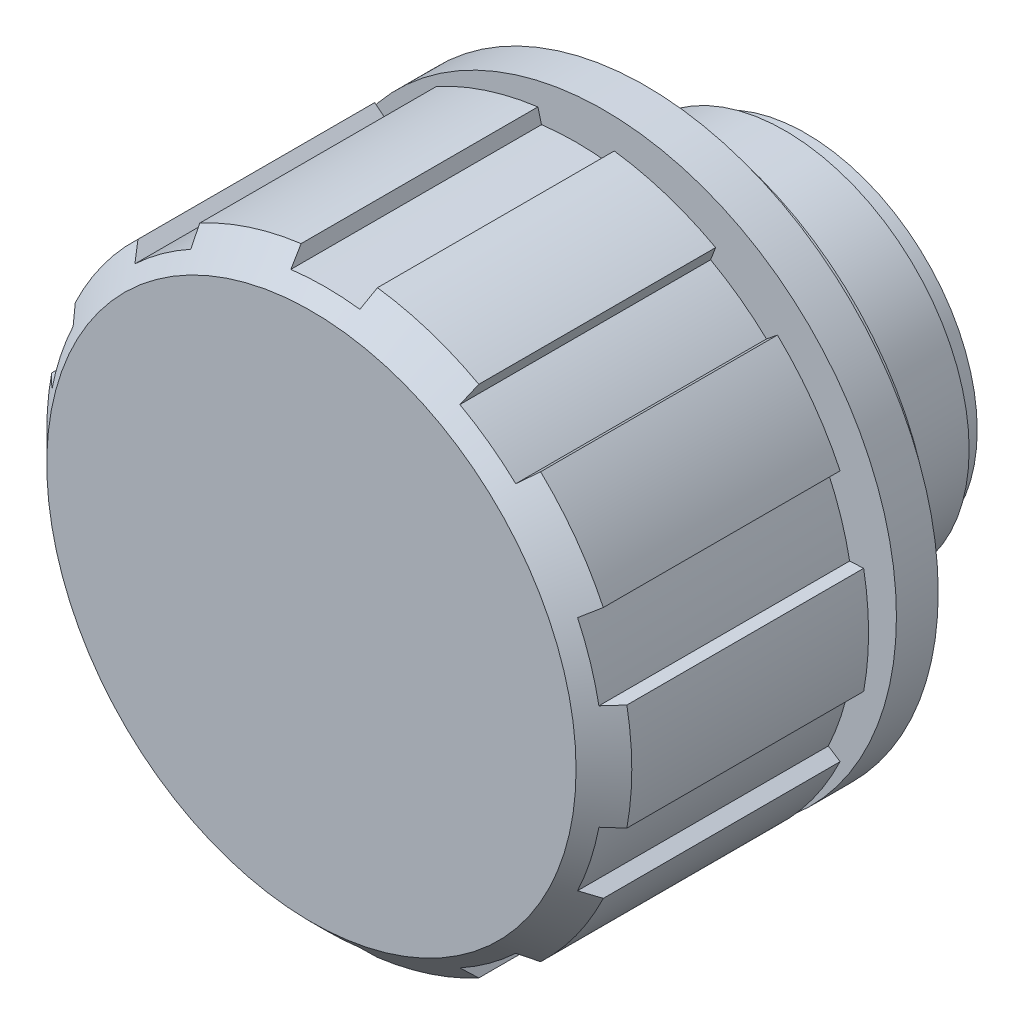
ISO-10303-21;
HEADER;
FILE_DESCRIPTION(('STEP AP214'),'2;1');
FILE_NAME('part.step','',(''),(''),'','','');
FILE_SCHEMA(('AUTOMOTIVE_DESIGN { 1 0 10303 214 1 1 1 1 }'));
ENDSEC;
DATA;
#1=APPLICATION_CONTEXT('core data for automotive mechanical design processes');
#2=APPLICATION_PROTOCOL_DEFINITION('international standard','automotive_design',2000,#1);
#3=PRODUCT_CONTEXT('',#1,'mechanical');
#4=PRODUCT('Part','Part','',(#3));
#5=PRODUCT_RELATED_PRODUCT_CATEGORY('part','',(#4));
#6=PRODUCT_DEFINITION_FORMATION('','',#4);
#7=PRODUCT_DEFINITION_CONTEXT('part definition',#1,'design');
#8=PRODUCT_DEFINITION('design','',#6,#7);
#9=PRODUCT_DEFINITION_SHAPE('','',#8);
#10=(LENGTH_UNIT() NAMED_UNIT(*) SI_UNIT(.MILLI.,.METRE.));
#11=(NAMED_UNIT(*) PLANE_ANGLE_UNIT() SI_UNIT($,.RADIAN.));
#12=(NAMED_UNIT(*) SI_UNIT($,.STERADIAN.) SOLID_ANGLE_UNIT());
#13=UNCERTAINTY_MEASURE_WITH_UNIT(LENGTH_MEASURE(1.E-05),#10,'distance_accuracy_value','');
#14=(GEOMETRIC_REPRESENTATION_CONTEXT(3) GLOBAL_UNCERTAINTY_ASSIGNED_CONTEXT((#13)) GLOBAL_UNIT_ASSIGNED_CONTEXT((#10,
#11,#12)) REPRESENTATION_CONTEXT('',''));
#15=CARTESIAN_POINT('',(0.,0.,0.));
#16=DIRECTION('',(0.,0.,1.));
#17=DIRECTION('',(1.,0.,0.));
#18=AXIS2_PLACEMENT_3D('',#15,#16,#17);
#19=CARTESIAN_POINT('',(0.,0.,23.5));
#20=DIRECTION('',(0.,0.,-1.));
#21=DIRECTION('',(-1.,0.,0.));
#22=AXIS2_PLACEMENT_3D('',#19,#20,#21);
#23=CONICAL_SURFACE('',#22,21.,0.785398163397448);
#24=CARTESIAN_POINT('',(2.74105003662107,20.82034208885,23.5));
#25=CARTESIAN_POINT('',(2.69753201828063,20.6579306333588,23.6667040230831));
#26=CARTESIAN_POINT('',(2.65400920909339,20.4955012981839,23.8333893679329));
#27=CARTESIAN_POINT('',(2.56695400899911,20.1706068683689,24.1667227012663));
#28=CARTESIAN_POINT('',(2.52342161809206,20.0081417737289,24.3333706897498));
#29=CARTESIAN_POINT('',(2.47988443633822,19.8456587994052,24.5));
#30=B_SPLINE_CURVE_WITH_KNOTS('',3,(#24,#25,#26,#27,#28,#29),.UNSPECIFIED.,.F.,.F.,(4,2,4),(0.,
0.710319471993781,1.42063894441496),.UNSPECIFIED.);
#31=CARTESIAN_POINT('',(2.74105003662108,20.82034208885,23.5));
#32=VERTEX_POINT('',#31);
#33=CARTESIAN_POINT('',(2.47988443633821,19.8456587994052,24.5));
#34=VERTEX_POINT('',#33);
#35=EDGE_CURVE('E608',#32,#34,#30,.T.);
#36=ORIENTED_EDGE('',*,*,#35,.T.);
#37=CARTESIAN_POINT('',(0.,0.,24.5));
#38=DIRECTION('',(0.,0.,-1.));
#39=DIRECTION('',(0.,1.,0.));
#40=AXIS2_PLACEMENT_3D('',#37,#38,#39);
#41=CIRCLE('',#40,20.);
#42=CARTESIAN_POINT('',(-2.47988443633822,19.8456587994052,24.5));
#43=VERTEX_POINT('',#42);
#44=EDGE_CURVE('E312',#34,#43,#41,.F.);
#45=ORIENTED_EDGE('',*,*,#44,.T.);
#46=CARTESIAN_POINT('',(-2.47988443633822,19.8456587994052,24.5));
#47=CARTESIAN_POINT('',(-2.52342161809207,20.0081417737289,24.3333706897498));
#48=CARTESIAN_POINT('',(-2.56695400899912,20.1706068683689,24.1667227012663));
#49=CARTESIAN_POINT('',(-2.6540092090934,20.4955012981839,23.8333893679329));
#50=CARTESIAN_POINT('',(-2.69753201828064,20.6579306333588,23.6667040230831));
#51=CARTESIAN_POINT('',(-2.74105003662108,20.82034208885,23.5));
#52=B_SPLINE_CURVE_WITH_KNOTS('',3,(#46,#47,#48,#49,#50,#51),.UNSPECIFIED.,.F.,.F.,(4,2,4),(0.,
0.710319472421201,1.420638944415),.UNSPECIFIED.);
#53=CARTESIAN_POINT('',(-2.74105003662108,20.82034208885,23.5));
#54=VERTEX_POINT('',#53);
#55=EDGE_CURVE('E748',#43,#54,#52,.T.);
#56=ORIENTED_EDGE('',*,*,#55,.T.);
#57=CARTESIAN_POINT('',(0.,0.,23.5));
#58=DIRECTION('',(0.,0.,-1.));
#59=DIRECTION('',(0.,1.,0.));
#60=AXIS2_PLACEMENT_3D('',#57,#58,#59);
#61=CIRCLE('',#60,21.);
#62=CARTESIAN_POINT('',(-10.0203339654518,18.4551593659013,23.5));
#63=VERTEX_POINT('',#62);
#64=EDGE_CURVE('E315',#54,#63,#61,.F.);
#65=ORIENTED_EDGE('',*,*,#64,.T.);
#66=CARTESIAN_POINT('',(-10.0203339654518,18.4551593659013,23.5));
#67=CARTESIAN_POINT('',(-9.96007772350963,18.2981864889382,23.6667040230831));
#68=CARTESIAN_POINT('',(-9.89981484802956,18.141196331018,23.8333893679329));
#69=CARTESIAN_POINT('',(-9.77927582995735,17.8271814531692,24.1667227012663));
#70=CARTESIAN_POINT('',(-9.7189996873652,17.6701567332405,24.3333706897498));
#71=CARTESIAN_POINT('',(-9.65871691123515,17.5131147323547,24.5));
#72=B_SPLINE_CURVE_WITH_KNOTS('',3,(#66,#67,#68,#69,#70,#71),.UNSPECIFIED.,.F.,.F.,(4,2,4),(0.,
0.710319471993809,1.42063894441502),.UNSPECIFIED.);
#73=CARTESIAN_POINT('',(-9.65871691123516,17.5131147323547,24.5));
#74=VERTEX_POINT('',#73);
#75=EDGE_CURVE('E596',#63,#74,#72,.T.);
#76=ORIENTED_EDGE('',*,*,#75,.T.);
#77=CARTESIAN_POINT('',(0.,0.,24.5));
#78=DIRECTION('',(0.,0.,-1.));
#79=DIRECTION('',(0.,1.,0.));
#80=AXIS2_PLACEMENT_3D('',#77,#78,#79);
#81=CIRCLE('',#80,20.);
#82=CARTESIAN_POINT('',(-13.6712542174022,14.5978357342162,24.5));
#83=VERTEX_POINT('',#82);
#84=EDGE_CURVE('E427',#74,#83,#81,.F.);
#85=ORIENTED_EDGE('',*,*,#84,.T.);
#86=CARTESIAN_POINT('',(-13.6712542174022,14.5978357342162,24.5));
#87=CARTESIAN_POINT('',(-13.8019816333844,14.7036967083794,24.3333706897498));
#88=CARTESIAN_POINT('',(-13.9326946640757,14.8095460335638,24.1667227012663));
#89=CARTESIAN_POINT('',(-14.1940919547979,15.021221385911,23.8333893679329));
#90=CARTESIAN_POINT('',(-14.3247762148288,15.1270474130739,23.6667040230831));
#91=CARTESIAN_POINT('',(-14.4554460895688,15.232861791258,23.5));
#92=B_SPLINE_CURVE_WITH_KNOTS('',3,(#86,#87,#88,#89,#90,#91),.UNSPECIFIED.,.F.,.F.,(4,2,4),(0.,
0.710319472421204,1.420638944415),.UNSPECIFIED.);
#93=CARTESIAN_POINT('',(-14.4554460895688,15.232861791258,23.5));
#94=VERTEX_POINT('',#93);
#95=EDGE_CURVE('E721',#83,#94,#92,.T.);
#96=ORIENTED_EDGE('',*,*,#95,.T.);
#97=CARTESIAN_POINT('',(0.,0.,23.5));
#98=DIRECTION('',(0.,0.,-1.));
#99=DIRECTION('',(0.,1.,0.));
#100=AXIS2_PLACEMENT_3D('',#97,#98,#99);
#101=CIRCLE('',#100,21.);
#102=CARTESIAN_POINT('',(-18.954290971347,9.04073303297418,23.5));
#103=VERTEX_POINT('',#102);
#104=EDGE_CURVE('E417',#94,#103,#101,.F.);
#105=ORIENTED_EDGE('',*,*,#104,.T.);
#106=CARTESIAN_POINT('',(-18.954290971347,9.04073303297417,23.5));
#107=CARTESIAN_POINT('',(-18.8132763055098,8.94915703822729,23.6667040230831));
#108=CARTESIAN_POINT('',(-18.6722461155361,8.85757096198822,23.8333893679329));
#109=CARTESIAN_POINT('',(-18.3901546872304,8.67437864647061,24.1667227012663));
#110=CARTESIAN_POINT('',(-18.2490934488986,8.58277240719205,24.3333706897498));
#111=CARTESIAN_POINT('',(-18.1080166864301,8.4911560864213,24.5));
#112=B_SPLINE_CURVE_WITH_KNOTS('',3,(#106,#107,#108,#109,#110,#111),.UNSPECIFIED.,.F.,.F.,(4,2,
4),(0.,0.710319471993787,1.42063894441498),.UNSPECIFIED.);
#113=CARTESIAN_POINT('',(-18.1080166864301,8.49115608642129,24.5));
#114=VERTEX_POINT('',#113);
#115=EDGE_CURVE('E715',#103,#114,#112,.T.);
#116=ORIENTED_EDGE('',*,*,#115,.T.);
#117=CARTESIAN_POINT('',(0.,0.,24.5));
#118=DIRECTION('',(0.,0.,-1.));
#119=DIRECTION('',(0.,1.,0.));
#120=AXIS2_PLACEMENT_3D('',#117,#118,#119);
#121=CIRCLE('',#120,20.);
#122=CARTESIAN_POINT('',(-19.640669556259,3.77413558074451,24.5));
#123=VERTEX_POINT('',#122);
#124=EDGE_CURVE('E407',#114,#123,#121,.F.);
#125=ORIENTED_EDGE('',*,*,#124,.T.);
#126=CARTESIAN_POINT('',(-19.640669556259,3.77413558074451,24.5));
#127=CARTESIAN_POINT('',(-19.8086537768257,3.78293926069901,24.3333706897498));
#128=CARTESIAN_POINT('',(-19.9766195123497,3.79174197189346,24.1667227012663));
#129=CARTESIAN_POINT('',(-20.312514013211,3.80934545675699,23.8333893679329));
#130=CARTESIAN_POINT('',(-20.4804427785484,3.81814623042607,23.6667040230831));
#131=CARTESIAN_POINT('',(-20.648353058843,3.8269460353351,23.5));
#132=B_SPLINE_CURVE_WITH_KNOTS('',3,(#126,#127,#128,#129,#130,#131),.UNSPECIFIED.,.F.,.F.,(4,2,
4),(0.,0.71031947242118,1.42063894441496),.UNSPECIFIED.);
#133=CARTESIAN_POINT('',(-20.648353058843,3.8269460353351,23.5));
#134=VERTEX_POINT('',#133);
#135=EDGE_CURVE('E708',#123,#134,#132,.T.);
#136=ORIENTED_EDGE('',*,*,#135,.T.);
#137=CARTESIAN_POINT('',(0.,0.,23.5));
#138=DIRECTION('',(0.,0.,-1.));
#139=DIRECTION('',(0.,1.,0.));
#140=AXIS2_PLACEMENT_3D('',#137,#138,#139);
#141=CIRCLE('',#140,21.);
#142=CARTESIAN_POINT('',(-20.648353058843,-3.8269460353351,23.5));
#143=VERTEX_POINT('',#142);
#144=EDGE_CURVE('E397',#134,#143,#141,.F.);
#145=ORIENTED_EDGE('',*,*,#144,.T.);
#146=CARTESIAN_POINT('',(-20.648353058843,-3.82694603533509,23.5));
#147=CARTESIAN_POINT('',(-20.4804427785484,-3.81814623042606,23.6667040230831));
#148=CARTESIAN_POINT('',(-20.312514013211,-3.80934545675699,23.8333893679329));
#149=CARTESIAN_POINT('',(-19.9766195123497,-3.79174197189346,24.1667227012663));
#150=CARTESIAN_POINT('',(-19.8086537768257,-3.78293926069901,24.3333706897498));
#151=CARTESIAN_POINT('',(-19.640669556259,-3.77413558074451,24.5));
#152=B_SPLINE_CURVE_WITH_KNOTS('',3,(#146,#147,#148,#149,#150,#151),.UNSPECIFIED.,.F.,.F.,(4,2,
4),(0.,0.710319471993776,1.42063894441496),.UNSPECIFIED.);
#153=CARTESIAN_POINT('',(-19.640669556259,-3.77413558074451,24.5));
#154=VERTEX_POINT('',#153);
#155=EDGE_CURVE('E700',#143,#154,#152,.T.);
#156=ORIENTED_EDGE('',*,*,#155,.T.);
#157=CARTESIAN_POINT('',(0.,0.,24.5));
#158=DIRECTION('',(0.,0.,-1.));
#159=DIRECTION('',(0.,1.,0.));
#160=AXIS2_PLACEMENT_3D('',#157,#158,#159);
#161=CIRCLE('',#160,20.);
#162=CARTESIAN_POINT('',(-18.1080166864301,-8.49115608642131,24.5));
#163=VERTEX_POINT('',#162);
#164=EDGE_CURVE('E387',#154,#163,#161,.F.);
#165=ORIENTED_EDGE('',*,*,#164,.T.);
#166=CARTESIAN_POINT('',(-18.1080166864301,-8.4911560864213,24.5));
#167=CARTESIAN_POINT('',(-18.2490934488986,-8.58277240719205,24.3333706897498));
#168=CARTESIAN_POINT('',(-18.3901546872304,-8.6743786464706,24.1667227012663));
#169=CARTESIAN_POINT('',(-18.6722461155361,-8.85757096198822,23.8333893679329));
#170=CARTESIAN_POINT('',(-18.8132763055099,-8.94915703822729,23.6667040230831));
#171=CARTESIAN_POINT('',(-18.9542909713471,-9.04073303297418,23.5));
#172=B_SPLINE_CURVE_WITH_KNOTS('',3,(#166,#167,#168,#169,#170,#171),.UNSPECIFIED.,.F.,.F.,(4,2,
4),(0.,0.710319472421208,1.42063894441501),.UNSPECIFIED.);
#173=CARTESIAN_POINT('',(-18.9542909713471,-9.04073303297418,23.5));
#174=VERTEX_POINT('',#173);
#175=EDGE_CURVE('E692',#163,#174,#172,.T.);
#176=ORIENTED_EDGE('',*,*,#175,.T.);
#177=CARTESIAN_POINT('',(0.,0.,23.5));
#178=DIRECTION('',(0.,0.,-1.));
#179=DIRECTION('',(0.,1.,0.));
#180=AXIS2_PLACEMENT_3D('',#177,#178,#179);
#181=CIRCLE('',#180,21.);
#182=CARTESIAN_POINT('',(-14.4554460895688,-15.2328617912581,23.5));
#183=VERTEX_POINT('',#182);
#184=EDGE_CURVE('E377',#174,#183,#181,.F.);
#185=ORIENTED_EDGE('',*,*,#184,.T.);
#186=CARTESIAN_POINT('',(-14.4554460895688,-15.232861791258,23.5));
#187=CARTESIAN_POINT('',(-14.3247762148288,-15.127047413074,23.6667040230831));
#188=CARTESIAN_POINT('',(-14.1940919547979,-15.021221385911,23.8333893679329));
#189=CARTESIAN_POINT('',(-13.9326946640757,-14.8095460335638,24.1667227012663));
#190=CARTESIAN_POINT('',(-13.8019816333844,-14.7036967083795,24.3333706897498));
#191=CARTESIAN_POINT('',(-13.6712542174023,-14.5978357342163,24.5));
#192=B_SPLINE_CURVE_WITH_KNOTS('',3,(#186,#187,#188,#189,#190,#191),.UNSPECIFIED.,.F.,.F.,(4,2,
4),(0.,0.7103194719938,1.420638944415),.UNSPECIFIED.);
#193=CARTESIAN_POINT('',(-13.6712542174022,-14.5978357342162,24.5));
#194=VERTEX_POINT('',#193);
#195=EDGE_CURVE('E684',#183,#194,#192,.T.);
#196=ORIENTED_EDGE('',*,*,#195,.T.);
#197=CARTESIAN_POINT('',(0.,0.,24.5));
#198=DIRECTION('',(0.,0.,-1.));
#199=DIRECTION('',(0.,1.,0.));
#200=AXIS2_PLACEMENT_3D('',#197,#198,#199);
#201=CIRCLE('',#200,20.);
#202=CARTESIAN_POINT('',(-9.65871691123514,-17.5131147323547,24.5));
#203=VERTEX_POINT('',#202);
#204=EDGE_CURVE('E367',#194,#203,#201,.F.);
#205=ORIENTED_EDGE('',*,*,#204,.T.);
#206=CARTESIAN_POINT('',(-9.65871691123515,-17.5131147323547,24.5));
#207=CARTESIAN_POINT('',(-9.7189996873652,-17.6701567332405,24.3333706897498));
#208=CARTESIAN_POINT('',(-9.77927582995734,-17.8271814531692,24.1667227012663));
#209=CARTESIAN_POINT('',(-9.89981484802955,-18.141196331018,23.8333893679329));
#210=CARTESIAN_POINT('',(-9.96007772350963,-18.2981864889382,23.6667040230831));
#211=CARTESIAN_POINT('',(-10.0203339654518,-18.4551593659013,23.5));
#212=B_SPLINE_CURVE_WITH_KNOTS('',3,(#206,#207,#208,#209,#210,#211),.UNSPECIFIED.,.F.,.F.,(4,2,
4),(0.,0.710319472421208,1.42063894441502),.UNSPECIFIED.);
#213=CARTESIAN_POINT('',(-10.0203339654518,-18.4551593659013,23.5));
#214=VERTEX_POINT('',#213);
#215=EDGE_CURVE('E676',#203,#214,#212,.T.);
#216=ORIENTED_EDGE('',*,*,#215,.T.);
#217=CARTESIAN_POINT('',(0.,0.,23.5));
#218=DIRECTION('',(0.,0.,-1.));
#219=DIRECTION('',(0.,1.,0.));
#220=AXIS2_PLACEMENT_3D('',#217,#218,#219);
#221=CIRCLE('',#220,21.);
#222=CARTESIAN_POINT('',(-2.74105003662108,-20.82034208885,23.5));
#223=VERTEX_POINT('',#222);
#224=EDGE_CURVE('E365',#214,#223,#221,.F.);
#225=ORIENTED_EDGE('',*,*,#224,.T.);
#226=CARTESIAN_POINT('',(-2.74105003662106,-20.82034208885,23.5));
#227=CARTESIAN_POINT('',(-2.69753201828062,-20.6579306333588,23.6667040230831));
#228=CARTESIAN_POINT('',(-2.65400920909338,-20.4955012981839,23.8333893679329));
#229=CARTESIAN_POINT('',(-2.56695400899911,-20.1706068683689,24.1667227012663));
#230=CARTESIAN_POINT('',(-2.52342161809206,-20.0081417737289,24.3333706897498));
#231=CARTESIAN_POINT('',(-2.47988443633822,-19.8456587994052,24.5));
#232=B_SPLINE_CURVE_WITH_KNOTS('',3,(#226,#227,#228,#229,#230,#231),.UNSPECIFIED.,.F.,.F.,(4,2,
4),(0.,0.71031947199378,1.42063894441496),.UNSPECIFIED.);
#233=CARTESIAN_POINT('',(-2.47988443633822,-19.8456587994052,24.5));
#234=VERTEX_POINT('',#233);
#235=EDGE_CURVE('E34',#223,#234,#232,.T.);
#236=ORIENTED_EDGE('',*,*,#235,.T.);
#237=CARTESIAN_POINT('',(0.,0.,24.5));
#238=DIRECTION('',(0.,0.,-1.));
#239=DIRECTION('',(0.,1.,0.));
#240=AXIS2_PLACEMENT_3D('',#237,#238,#239);
#241=CIRCLE('',#240,20.);
#242=CARTESIAN_POINT('',(2.47988443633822,-19.8456587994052,24.5));
#243=VERTEX_POINT('',#242);
#244=EDGE_CURVE('E304',#234,#243,#241,.F.);
#245=ORIENTED_EDGE('',*,*,#244,.T.);
#246=CARTESIAN_POINT('',(2.47988443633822,-19.8456587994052,24.5));
#247=CARTESIAN_POINT('',(2.52342161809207,-20.0081417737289,24.3333706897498));
#248=CARTESIAN_POINT('',(2.56695400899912,-20.1706068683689,24.1667227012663));
#249=CARTESIAN_POINT('',(2.6540092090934,-20.4955012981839,23.8333893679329));
#250=CARTESIAN_POINT('',(2.69753201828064,-20.6579306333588,23.6667040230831));
#251=CARTESIAN_POINT('',(2.74105003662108,-20.82034208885,23.5));
#252=B_SPLINE_CURVE_WITH_KNOTS('',3,(#246,#247,#248,#249,#250,#251),.UNSPECIFIED.,.F.,.F.,(4,2,
4),(0.,0.7103194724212,1.420638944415),.UNSPECIFIED.);
#253=CARTESIAN_POINT('',(2.74105003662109,-20.82034208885,23.5));
#254=VERTEX_POINT('',#253);
#255=EDGE_CURVE('E153',#243,#254,#252,.T.);
#256=ORIENTED_EDGE('',*,*,#255,.T.);
#257=CARTESIAN_POINT('',(0.,0.,23.5));
#258=DIRECTION('',(0.,0.,-1.));
#259=DIRECTION('',(0.,1.,0.));
#260=AXIS2_PLACEMENT_3D('',#257,#258,#259);
#261=CIRCLE('',#260,21.);
#262=CARTESIAN_POINT('',(10.0203339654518,-18.4551593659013,23.5));
#263=VERTEX_POINT('',#262);
#264=EDGE_CURVE('E325',#254,#263,#261,.F.);
#265=ORIENTED_EDGE('',*,*,#264,.T.);
#266=CARTESIAN_POINT('',(10.0203339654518,-18.4551593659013,23.5));
#267=CARTESIAN_POINT('',(9.96007772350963,-18.2981864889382,23.6667040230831));
#268=CARTESIAN_POINT('',(9.89981484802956,-18.141196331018,23.8333893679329));
#269=CARTESIAN_POINT('',(9.77927582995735,-17.8271814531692,24.1667227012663));
#270=CARTESIAN_POINT('',(9.71899968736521,-17.6701567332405,24.3333706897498));
#271=CARTESIAN_POINT('',(9.65871691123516,-17.5131147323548,24.5));
#272=B_SPLINE_CURVE_WITH_KNOTS('',3,(#266,#267,#268,#269,#270,#271),.UNSPECIFIED.,.F.,.F.,(4,2,
4),(0.,0.710319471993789,1.42063894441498),.UNSPECIFIED.);
#273=CARTESIAN_POINT('',(9.65871691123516,-17.5131147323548,24.5));
#274=VERTEX_POINT('',#273);
#275=EDGE_CURVE('E147',#263,#274,#272,.T.);
#276=ORIENTED_EDGE('',*,*,#275,.T.);
#277=CARTESIAN_POINT('',(0.,0.,24.5));
#278=DIRECTION('',(0.,0.,-1.));
#279=DIRECTION('',(0.,1.,0.));
#280=AXIS2_PLACEMENT_3D('',#277,#278,#279);
#281=CIRCLE('',#280,20.);
#282=CARTESIAN_POINT('',(13.6712542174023,-14.5978357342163,24.5));
#283=VERTEX_POINT('',#282);
#284=EDGE_CURVE('E517',#274,#283,#281,.F.);
#285=ORIENTED_EDGE('',*,*,#284,.T.);
#286=CARTESIAN_POINT('',(13.6712542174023,-14.5978357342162,24.5));
#287=CARTESIAN_POINT('',(13.8019816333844,-14.7036967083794,24.3333706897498));
#288=CARTESIAN_POINT('',(13.9326946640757,-14.8095460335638,24.1667227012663));
#289=CARTESIAN_POINT('',(14.1940919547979,-15.021221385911,23.8333893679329));
#290=CARTESIAN_POINT('',(14.3247762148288,-15.1270474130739,23.6667040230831));
#291=CARTESIAN_POINT('',(14.4554460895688,-15.232861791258,23.5));
#292=B_SPLINE_CURVE_WITH_KNOTS('',3,(#286,#287,#288,#289,#290,#291),.UNSPECIFIED.,.F.,.F.,(4,2,
4),(0.,0.710319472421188,1.42063894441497),.UNSPECIFIED.);
#293=CARTESIAN_POINT('',(14.4554460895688,-15.232861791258,23.5));
#294=VERTEX_POINT('',#293);
#295=EDGE_CURVE('E669',#283,#294,#292,.T.);
#296=ORIENTED_EDGE('',*,*,#295,.T.);
#297=CARTESIAN_POINT('',(0.,0.,23.5));
#298=DIRECTION('',(0.,0.,-1.));
#299=DIRECTION('',(0.,1.,0.));
#300=AXIS2_PLACEMENT_3D('',#297,#298,#299);
#301=CIRCLE('',#300,21.);
#302=CARTESIAN_POINT('',(18.954290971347,-9.04073303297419,23.5));
#303=VERTEX_POINT('',#302);
#304=EDGE_CURVE('E507',#294,#303,#301,.F.);
#305=ORIENTED_EDGE('',*,*,#304,.T.);
#306=CARTESIAN_POINT('',(18.954290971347,-9.04073303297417,23.5));
#307=CARTESIAN_POINT('',(18.8132763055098,-8.94915703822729,23.6667040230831));
#308=CARTESIAN_POINT('',(18.6722461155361,-8.85757096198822,23.8333893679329));
#309=CARTESIAN_POINT('',(18.3901546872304,-8.67437864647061,24.1667227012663));
#310=CARTESIAN_POINT('',(18.2490934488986,-8.58277240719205,24.3333706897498));
#311=CARTESIAN_POINT('',(18.1080166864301,-8.4911560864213,24.5));
#312=B_SPLINE_CURVE_WITH_KNOTS('',3,(#306,#307,#308,#309,#310,#311),.UNSPECIFIED.,.F.,.F.,(4,2,
4),(0.,0.710319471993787,1.42063894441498),.UNSPECIFIED.);
#313=CARTESIAN_POINT('',(18.1080166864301,-8.4911560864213,24.5));
#314=VERTEX_POINT('',#313);
#315=EDGE_CURVE('E656',#303,#314,#312,.T.);
#316=ORIENTED_EDGE('',*,*,#315,.T.);
#317=CARTESIAN_POINT('',(0.,0.,24.5));
#318=DIRECTION('',(0.,0.,-1.));
#319=DIRECTION('',(0.,1.,0.));
#320=AXIS2_PLACEMENT_3D('',#317,#318,#319);
#321=CIRCLE('',#320,20.);
#322=CARTESIAN_POINT('',(19.640669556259,-3.77413558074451,24.5));
#323=VERTEX_POINT('',#322);
#324=EDGE_CURVE('E497',#314,#323,#321,.F.);
#325=ORIENTED_EDGE('',*,*,#324,.T.);
#326=CARTESIAN_POINT('',(19.640669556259,-3.77413558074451,24.5));
#327=CARTESIAN_POINT('',(19.8086537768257,-3.78293926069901,24.3333706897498));
#328=CARTESIAN_POINT('',(19.9766195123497,-3.79174197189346,24.1667227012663));
#329=CARTESIAN_POINT('',(20.312514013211,-3.80934545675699,23.8333893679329));
#330=CARTESIAN_POINT('',(20.4804427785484,-3.81814623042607,23.6667040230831));
#331=CARTESIAN_POINT('',(20.648353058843,-3.8269460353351,23.5));
#332=B_SPLINE_CURVE_WITH_KNOTS('',3,(#326,#327,#328,#329,#330,#331),.UNSPECIFIED.,.F.,.F.,(4,2,
4),(0.,0.71031947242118,1.42063894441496),.UNSPECIFIED.);
#333=CARTESIAN_POINT('',(20.648353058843,-3.8269460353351,23.5));
#334=VERTEX_POINT('',#333);
#335=EDGE_CURVE('E648',#323,#334,#332,.T.);
#336=ORIENTED_EDGE('',*,*,#335,.T.);
#337=CARTESIAN_POINT('',(0.,0.,23.5));
#338=DIRECTION('',(0.,0.,-1.));
#339=DIRECTION('',(0.,1.,0.));
#340=AXIS2_PLACEMENT_3D('',#337,#338,#339);
#341=CIRCLE('',#340,21.);
#342=CARTESIAN_POINT('',(20.648353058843,3.82694603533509,23.5));
#343=VERTEX_POINT('',#342);
#344=EDGE_CURVE('E487',#334,#343,#341,.F.);
#345=ORIENTED_EDGE('',*,*,#344,.T.);
#346=CARTESIAN_POINT('',(20.648353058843,3.82694603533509,23.5));
#347=CARTESIAN_POINT('',(20.4804427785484,3.81814623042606,23.6667040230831));
#348=CARTESIAN_POINT('',(20.312514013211,3.80934545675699,23.8333893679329));
#349=CARTESIAN_POINT('',(19.9766195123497,3.79174197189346,24.1667227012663));
#350=CARTESIAN_POINT('',(19.8086537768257,3.782939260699,24.3333706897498));
#351=CARTESIAN_POINT('',(19.640669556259,3.77413558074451,24.5));
#352=B_SPLINE_CURVE_WITH_KNOTS('',3,(#346,#347,#348,#349,#350,#351),.UNSPECIFIED.,.F.,.F.,(4,2,
4),(0.,0.710319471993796,1.42063894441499),.UNSPECIFIED.);
#353=CARTESIAN_POINT('',(19.640669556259,3.77413558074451,24.5));
#354=VERTEX_POINT('',#353);
#355=EDGE_CURVE('E640',#343,#354,#352,.T.);
#356=ORIENTED_EDGE('',*,*,#355,.T.);
#357=CARTESIAN_POINT('',(0.,0.,24.5));
#358=DIRECTION('',(0.,0.,-1.));
#359=DIRECTION('',(0.,1.,0.));
#360=AXIS2_PLACEMENT_3D('',#357,#358,#359);
#361=CIRCLE('',#360,20.);
#362=CARTESIAN_POINT('',(18.1080166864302,8.49115608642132,24.5));
#363=VERTEX_POINT('',#362);
#364=EDGE_CURVE('E477',#354,#363,#361,.F.);
#365=ORIENTED_EDGE('',*,*,#364,.T.);
#366=CARTESIAN_POINT('',(18.1080166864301,8.4911560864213,24.5));
#367=CARTESIAN_POINT('',(18.2490934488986,8.58277240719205,24.3333706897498));
#368=CARTESIAN_POINT('',(18.3901546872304,8.6743786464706,24.1667227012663));
#369=CARTESIAN_POINT('',(18.6722461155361,8.85757096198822,23.8333893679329));
#370=CARTESIAN_POINT('',(18.8132763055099,8.94915703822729,23.6667040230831));
#371=CARTESIAN_POINT('',(18.9542909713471,9.04073303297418,23.5));
#372=B_SPLINE_CURVE_WITH_KNOTS('',3,(#366,#367,#368,#369,#370,#371),.UNSPECIFIED.,.F.,.F.,(4,2,
4),(0.,0.710319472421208,1.42063894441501),.UNSPECIFIED.);
#373=CARTESIAN_POINT('',(18.9542909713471,9.04073303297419,23.5));
#374=VERTEX_POINT('',#373);
#375=EDGE_CURVE('E632',#363,#374,#372,.T.);
#376=ORIENTED_EDGE('',*,*,#375,.T.);
#377=CARTESIAN_POINT('',(0.,0.,23.5));
#378=DIRECTION('',(0.,0.,-1.));
#379=DIRECTION('',(0.,1.,0.));
#380=AXIS2_PLACEMENT_3D('',#377,#378,#379);
#381=CIRCLE('',#380,21.);
#382=CARTESIAN_POINT('',(14.4554460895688,15.232861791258,23.5));
#383=VERTEX_POINT('',#382);
#384=EDGE_CURVE('E467',#374,#383,#381,.F.);
#385=ORIENTED_EDGE('',*,*,#384,.T.);
#386=CARTESIAN_POINT('',(14.4554460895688,15.232861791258,23.5));
#387=CARTESIAN_POINT('',(14.3247762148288,15.127047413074,23.6667040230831));
#388=CARTESIAN_POINT('',(14.1940919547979,15.021221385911,23.8333893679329));
#389=CARTESIAN_POINT('',(13.9326946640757,14.8095460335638,24.1667227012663));
#390=CARTESIAN_POINT('',(13.8019816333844,14.7036967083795,24.3333706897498));
#391=CARTESIAN_POINT('',(13.6712542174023,14.5978357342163,24.5));
#392=B_SPLINE_CURVE_WITH_KNOTS('',3,(#386,#387,#388,#389,#390,#391),.UNSPECIFIED.,.F.,.F.,(4,2,
4),(0.,0.710319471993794,1.42063894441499),.UNSPECIFIED.);
#393=CARTESIAN_POINT('',(13.6712542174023,14.5978357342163,24.5));
#394=VERTEX_POINT('',#393);
#395=EDGE_CURVE('E624',#383,#394,#392,.T.);
#396=ORIENTED_EDGE('',*,*,#395,.T.);
#397=CARTESIAN_POINT('',(0.,0.,24.5));
#398=DIRECTION('',(0.,0.,-1.));
#399=DIRECTION('',(0.,1.,0.));
#400=AXIS2_PLACEMENT_3D('',#397,#398,#399);
#401=CIRCLE('',#400,20.);
#402=CARTESIAN_POINT('',(9.65871691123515,17.5131147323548,24.5));
#403=VERTEX_POINT('',#402);
#404=EDGE_CURVE('E457',#394,#403,#401,.F.);
#405=ORIENTED_EDGE('',*,*,#404,.T.);
#406=CARTESIAN_POINT('',(9.65871691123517,17.5131147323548,24.5));
#407=CARTESIAN_POINT('',(9.71899968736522,17.6701567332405,24.3333706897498));
#408=CARTESIAN_POINT('',(9.77927582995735,17.8271814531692,24.1667227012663));
#409=CARTESIAN_POINT('',(9.89981484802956,18.1411963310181,23.8333893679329));
#410=CARTESIAN_POINT('',(9.96007772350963,18.2981864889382,23.6667040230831));
#411=CARTESIAN_POINT('',(10.0203339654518,18.4551593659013,23.5));
#412=B_SPLINE_CURVE_WITH_KNOTS('',3,(#406,#407,#408,#409,#410,#411),.UNSPECIFIED.,.F.,.F.,(4,2,
4),(0.,0.710319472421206,1.42063894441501),.UNSPECIFIED.);
#413=CARTESIAN_POINT('',(10.0203339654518,18.4551593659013,23.5));
#414=VERTEX_POINT('',#413);
#415=EDGE_CURVE('E616',#403,#414,#412,.T.);
#416=ORIENTED_EDGE('',*,*,#415,.T.);
#417=CARTESIAN_POINT('',(0.,0.,23.5));
#418=DIRECTION('',(0.,0.,-1.));
#419=DIRECTION('',(0.,1.,0.));
#420=AXIS2_PLACEMENT_3D('',#417,#418,#419);
#421=CIRCLE('',#420,21.);
#422=EDGE_CURVE('E316',#414,#32,#421,.F.);
#423=ORIENTED_EDGE('',*,*,#422,.T.);
#424=EDGE_LOOP('',(#36,#45,#56,#65,#76,#85,#96,#105,#116,#125,#136,#145,#156,#165,#176,#185,
#196,#205,#216,#225,#236,#245,#256,#265,#276,#285,#296,#305,#316,#325,#336,#345,#356,#365,#376,
#385,#396,#405,#416,#423));
#425=FACE_BOUND('',#424,.T.);
#426=CARTESIAN_POINT('',(0.,0.,25.5));
#427=DIRECTION('',(0.,0.,1.));
#428=DIRECTION('',(1.,0.,0.));
#429=AXIS2_PLACEMENT_3D('',#426,#427,#428);
#430=CIRCLE('',#429,19.);
#431=CARTESIAN_POINT('',(19.,0.,25.5));
#432=VERTEX_POINT('',#431);
#433=EDGE_CURVE('E19',#432,#432,#430,.F.);
#434=ORIENTED_EDGE('',*,*,#433,.T.);
#435=EDGE_LOOP('',(#434));
#436=FACE_BOUND('',#435,.T.);
#437=ADVANCED_FACE('F14',(#425,#436),#23,.T.);
#438=CARTESIAN_POINT('',(0.,4.5,4.5));
#439=DIRECTION('',(0.,0.,-1.));
#440=DIRECTION('',(-1.,0.,0.));
#441=AXIS2_PLACEMENT_3D('',#438,#439,#440);
#442=PLANE('',#441);
#443=CARTESIAN_POINT('',(0.,0.,4.5));
#444=DIRECTION('',(0.,0.,1.));
#445=DIRECTION('',(1.,0.,0.));
#446=AXIS2_PLACEMENT_3D('',#443,#444,#445);
#447=CIRCLE('',#446,9.);
#448=CARTESIAN_POINT('',(9.,0.,4.5));
#449=VERTEX_POINT('',#448);
#450=EDGE_CURVE('E791',#449,#449,#447,.F.);
#451=ORIENTED_EDGE('',*,*,#450,.T.);
#452=EDGE_LOOP('',(#451));
#453=FACE_BOUND('',#452,.T.);
#454=ADVANCED_FACE('F590',(#453),#442,.T.);
#455=CARTESIAN_POINT('',(0.,0.,-2.75));
#456=DIRECTION('',(0.,0.,1.));
#457=DIRECTION('',(1.,0.,0.));
#458=AXIS2_PLACEMENT_3D('',#455,#456,#457);
#459=CYLINDRICAL_SURFACE('',#458,9.);
#460=ORIENTED_EDGE('',*,*,#450,.F.);
#461=EDGE_LOOP('',(#460));
#462=FACE_BOUND('',#461,.T.);
#463=CARTESIAN_POINT('',(0.,0.,-10.));
#464=DIRECTION('',(0.,0.,1.));
#465=DIRECTION('',(1.,0.,0.));
#466=AXIS2_PLACEMENT_3D('',#463,#464,#465);
#467=CIRCLE('',#466,9.);
#468=CARTESIAN_POINT('',(9.,0.,-10.));
#469=VERTEX_POINT('',#468);
#470=EDGE_CURVE('E792',#469,#469,#467,.T.);
#471=ORIENTED_EDGE('',*,*,#470,.F.);
#472=EDGE_LOOP('',(#471));
#473=FACE_BOUND('',#472,.T.);
#474=ADVANCED_FACE('F782',(#462,#473),#459,.F.);
#475=CARTESIAN_POINT('',(0.,10.64992375,-10.));
#476=DIRECTION('',(0.,0.,-1.));
#477=DIRECTION('',(-1.,0.,0.));
#478=AXIS2_PLACEMENT_3D('',#475,#476,#477);
#479=PLANE('',#478);
#480=CARTESIAN_POINT('',(0.,0.,-10.));
#481=DIRECTION('',(0.,0.,1.));
#482=DIRECTION('',(1.,0.,0.));
#483=AXIS2_PLACEMENT_3D('',#480,#481,#482);
#484=CIRCLE('',#483,12.2998475);
#485=CARTESIAN_POINT('',(12.2998475,0.,-10.));
#486=VERTEX_POINT('',#485);
#487=EDGE_CURVE('E795',#486,#486,#484,.T.);
#488=ORIENTED_EDGE('',*,*,#487,.F.);
#489=EDGE_LOOP('',(#488));
#490=FACE_BOUND('',#489,.T.);
#491=ORIENTED_EDGE('',*,*,#470,.T.);
#492=EDGE_LOOP('',(#491));
#493=FACE_BOUND('',#492,.T.);
#494=ADVANCED_FACE('F787',(#490,#493),#479,.T.);
#495=CARTESIAN_POINT('',(0.,0.,-9.25));
#496=DIRECTION('',(0.,0.,1.));
#497=DIRECTION('',(1.,0.,0.));
#498=AXIS2_PLACEMENT_3D('',#495,#496,#497);
#499=CYLINDRICAL_SURFACE('',#498,12.2998475);
#500=ORIENTED_EDGE('',*,*,#487,.T.);
#501=EDGE_LOOP('',(#500));
#502=FACE_BOUND('',#501,.T.);
#503=CARTESIAN_POINT('',(0.,0.,-8.5));
#504=DIRECTION('',(0.,0.,1.));
#505=DIRECTION('',(1.,0.,0.));
#506=AXIS2_PLACEMENT_3D('',#503,#504,#505);
#507=CIRCLE('',#506,12.2998475);
#508=CARTESIAN_POINT('',(12.2998475,0.,-8.5));
#509=VERTEX_POINT('',#508);
#510=EDGE_CURVE('E800',#509,#509,#507,.T.);
#511=ORIENTED_EDGE('',*,*,#510,.F.);
#512=EDGE_LOOP('',(#511));
#513=FACE_BOUND('',#512,.T.);
#514=ADVANCED_FACE('F860',(#502,#513),#499,.T.);
#515=CARTESIAN_POINT('',(0.,12.75992375,-8.5));
#516=DIRECTION('',(0.,0.,-1.));
#517=DIRECTION('',(0.,-1.,0.));
#518=AXIS2_PLACEMENT_3D('',#515,#516,#517);
#519=PLANE('',#518);
#520=CARTESIAN_POINT('',(0.,0.,-8.5));
#521=DIRECTION('',(0.,0.,1.));
#522=DIRECTION('',(1.,0.,0.));
#523=AXIS2_PLACEMENT_3D('',#520,#521,#522);
#524=CIRCLE('',#523,13.22);
#525=CARTESIAN_POINT('',(13.22,0.,-8.5));
#526=VERTEX_POINT('',#525);
#527=EDGE_CURVE('E803',#526,#526,#524,.T.);
#528=ORIENTED_EDGE('',*,*,#527,.F.);
#529=EDGE_LOOP('',(#528));
#530=FACE_BOUND('',#529,.T.);
#531=ORIENTED_EDGE('',*,*,#510,.T.);
#532=EDGE_LOOP('',(#531));
#533=FACE_BOUND('',#532,.T.);
#534=ADVANCED_FACE('F856',(#530,#533),#519,.T.);
#535=CARTESIAN_POINT('',(0.,0.,-4.25));
#536=DIRECTION('',(0.,0.,1.));
#537=DIRECTION('',(1.,0.,0.));
#538=AXIS2_PLACEMENT_3D('',#535,#536,#537);
#539=CYLINDRICAL_SURFACE('',#538,13.22);
#540=ORIENTED_EDGE('',*,*,#527,.T.);
#541=EDGE_LOOP('',(#540));
#542=FACE_BOUND('',#541,.T.);
#543=CARTESIAN_POINT('',(0.,0.,0.));
#544=DIRECTION('',(0.,0.,1.));
#545=DIRECTION('',(1.,0.,0.));
#546=AXIS2_PLACEMENT_3D('',#543,#544,#545);
#547=CIRCLE('',#546,13.22);
#548=CARTESIAN_POINT('',(13.22,0.,0.));
#549=VERTEX_POINT('',#548);
#550=EDGE_CURVE('E806',#549,#549,#547,.T.);
#551=ORIENTED_EDGE('',*,*,#550,.F.);
#552=EDGE_LOOP('',(#551));
#553=FACE_BOUND('',#552,.T.);
#554=ADVANCED_FACE('F852',(#542,#553),#539,.T.);
#555=CARTESIAN_POINT('',(0.,16.1554545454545,0.));
#556=DIRECTION('',(0.,0.,-1.));
#557=DIRECTION('',(-1.,0.,0.));
#558=AXIS2_PLACEMENT_3D('',#555,#556,#557);
#559=PLANE('',#558);
#560=CARTESIAN_POINT('',(0.,0.,0.));
#561=DIRECTION('',(0.,0.,1.));
#562=DIRECTION('',(1.,0.,0.));
#563=AXIS2_PLACEMENT_3D('',#560,#561,#562);
#564=CIRCLE('',#563,19.0909090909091);
#565=CARTESIAN_POINT('',(19.0909090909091,0.,0.));
#566=VERTEX_POINT('',#565);
#567=EDGE_CURVE('E809',#566,#566,#564,.T.);
#568=ORIENTED_EDGE('',*,*,#567,.F.);
#569=EDGE_LOOP('',(#568));
#570=FACE_BOUND('',#569,.T.);
#571=ORIENTED_EDGE('',*,*,#550,.T.);
#572=EDGE_LOOP('',(#571));
#573=FACE_BOUND('',#572,.T.);
#574=ADVANCED_FACE('F848',(#570,#573),#559,.T.);
#575=CARTESIAN_POINT('',(0.,0.,0.75));
#576=DIRECTION('',(0.,0.,1.));
#577=DIRECTION('',(1.,0.,0.));
#578=AXIS2_PLACEMENT_3D('',#575,#576,#577);
#579=CYLINDRICAL_SURFACE('',#578,19.0909090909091);
#580=ORIENTED_EDGE('',*,*,#567,.T.);
#581=EDGE_LOOP('',(#580));
#582=FACE_BOUND('',#581,.T.);
#583=CARTESIAN_POINT('',(0.,0.,1.5));
#584=DIRECTION('',(0.,0.,1.));
#585=DIRECTION('',(1.,0.,0.));
#586=AXIS2_PLACEMENT_3D('',#583,#584,#585);
#587=CIRCLE('',#586,19.0909090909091);
#588=CARTESIAN_POINT('',(19.0909090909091,0.,1.5));
#589=VERTEX_POINT('',#588);
#590=EDGE_CURVE('E812',#589,#589,#587,.T.);
#591=ORIENTED_EDGE('',*,*,#590,.F.);
#592=EDGE_LOOP('',(#591));
#593=FACE_BOUND('',#592,.T.);
#594=ADVANCED_FACE('F841',(#582,#593),#579,.T.);
#595=CARTESIAN_POINT('',(0.,20.0454545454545,1.5));
#596=DIRECTION('',(0.,0.,-1.));
#597=DIRECTION('',(-1.,0.,0.));
#598=AXIS2_PLACEMENT_3D('',#595,#596,#597);
#599=PLANE('',#598);
#600=CARTESIAN_POINT('',(0.,0.,1.5));
#601=DIRECTION('',(0.,0.,1.));
#602=DIRECTION('',(1.,0.,0.));
#603=AXIS2_PLACEMENT_3D('',#600,#601,#602);
#604=CIRCLE('',#603,21.);
#605=CARTESIAN_POINT('',(21.,0.,1.5));
#606=VERTEX_POINT('',#605);
#607=EDGE_CURVE('E815',#606,#606,#604,.T.);
#608=ORIENTED_EDGE('',*,*,#607,.F.);
#609=EDGE_LOOP('',(#608));
#610=FACE_BOUND('',#609,.T.);
#611=ORIENTED_EDGE('',*,*,#590,.T.);
#612=EDGE_LOOP('',(#611));
#613=FACE_BOUND('',#612,.T.);
#614=ADVANCED_FACE('F835',(#610,#613),#599,.T.);
#615=CARTESIAN_POINT('',(0.,0.,3.));
#616=DIRECTION('',(0.,0.,1.));
#617=DIRECTION('',(1.,0.,0.));
#618=AXIS2_PLACEMENT_3D('',#615,#616,#617);
#619=CYLINDRICAL_SURFACE('',#618,21.);
#620=ORIENTED_EDGE('',*,*,#607,.T.);
#621=EDGE_LOOP('',(#620));
#622=FACE_BOUND('',#621,.T.);
#623=CARTESIAN_POINT('',(0.,0.,4.5));
#624=DIRECTION('',(0.,0.,1.));
#625=DIRECTION('',(1.,0.,0.));
#626=AXIS2_PLACEMENT_3D('',#623,#624,#625);
#627=CIRCLE('',#626,21.);
#628=CARTESIAN_POINT('',(21.,0.,4.5));
#629=VERTEX_POINT('',#628);
#630=EDGE_CURVE('E818',#629,#629,#627,.T.);
#631=ORIENTED_EDGE('',*,*,#630,.F.);
#632=EDGE_LOOP('',(#631));
#633=FACE_BOUND('',#632,.T.);
#634=ADVANCED_FACE('F830',(#622,#633),#619,.T.);
#635=CARTESIAN_POINT('',(0.,17.5,4.5));
#636=DIRECTION('',(0.,0.,1.));
#637=DIRECTION('',(1.,0.,0.));
#638=AXIS2_PLACEMENT_3D('',#635,#636,#637);
#639=PLANE('',#638);
#640=CARTESIAN_POINT('',(0.,0.,4.5));
#641=DIRECTION('',(0.,0.,1.));
#642=DIRECTION('',(1.,0.,0.));
#643=AXIS2_PLACEMENT_3D('',#640,#641,#642);
#644=CIRCLE('',#643,14.);
#645=CARTESIAN_POINT('',(14.,0.,4.5));
#646=VERTEX_POINT('',#645);
#647=EDGE_CURVE('E25',#646,#646,#644,.T.);
#648=ORIENTED_EDGE('',*,*,#647,.F.);
#649=EDGE_LOOP('',(#648));
#650=FACE_BOUND('',#649,.T.);
#651=ORIENTED_EDGE('',*,*,#630,.T.);
#652=EDGE_LOOP('',(#651));
#653=FACE_BOUND('',#652,.T.);
#654=ADVANCED_FACE('F827',(#650,#653),#639,.T.);
#655=CARTESIAN_POINT('',(0.,0.,5.5));
#656=DIRECTION('',(0.,0.,1.));
#657=DIRECTION('',(1.,0.,0.));
#658=AXIS2_PLACEMENT_3D('',#655,#656,#657);
#659=CYLINDRICAL_SURFACE('',#658,14.);
#660=ORIENTED_EDGE('',*,*,#647,.T.);
#661=EDGE_LOOP('',(#660));
#662=FACE_BOUND('',#661,.T.);
#663=CARTESIAN_POINT('',(0.,0.,6.5));
#664=DIRECTION('',(0.,0.,1.));
#665=DIRECTION('',(1.,0.,0.));
#666=AXIS2_PLACEMENT_3D('',#663,#664,#665);
#667=CIRCLE('',#666,14.);
#668=CARTESIAN_POINT('',(14.,0.,6.5));
#669=VERTEX_POINT('',#668);
#670=EDGE_CURVE('E9',#669,#669,#667,.T.);
#671=ORIENTED_EDGE('',*,*,#670,.F.);
#672=EDGE_LOOP('',(#671));
#673=FACE_BOUND('',#672,.T.);
#674=ADVANCED_FACE('F824',(#662,#673),#659,.T.);
#675=CARTESIAN_POINT('',(0.,15.4,6.5));
#676=DIRECTION('',(0.,0.,-1.));
#677=DIRECTION('',(-1.,0.,0.));
#678=AXIS2_PLACEMENT_3D('',#675,#676,#677);
#679=PLANE('',#678);
#680=ORIENTED_EDGE('',*,*,#670,.T.);
#681=EDGE_LOOP('',(#680));
#682=FACE_BOUND('',#681,.T.);
#683=CARTESIAN_POINT('',(0.,0.,6.5));
#684=DIRECTION('',(0.,0.,1.));
#685=DIRECTION('',(1.,0.,0.));
#686=AXIS2_PLACEMENT_3D('',#683,#684,#685);
#687=CIRCLE('',#686,21.);
#688=CARTESIAN_POINT('',(-20.648353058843,3.8269460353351,6.5));
#689=VERTEX_POINT('',#688);
#690=CARTESIAN_POINT('',(-20.648353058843,-3.8269460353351,6.5));
#691=VERTEX_POINT('',#690);
#692=EDGE_CURVE('E401',#689,#691,#687,.T.);
#693=ORIENTED_EDGE('',*,*,#692,.F.);
#694=DIRECTION('',(0.998629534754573,-0.0523359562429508,0.));
#695=VECTOR('',#694,1.);
#696=CARTESIAN_POINT('',(-20.648353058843,3.8269460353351,6.5));
#697=LINE('',#696,#695);
#698=CARTESIAN_POINT('',(-19.640669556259,3.77413558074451,6.5));
#699=VERTEX_POINT('',#698);
#700=EDGE_CURVE('E327',#689,#699,#697,.T.);
#701=ORIENTED_EDGE('',*,*,#700,.T.);
#702=CARTESIAN_POINT('',(1.98951966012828E-13,-1.04805053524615E-13,6.5));
#703=DIRECTION('',(0.,0.,1.));
#704=DIRECTION('',(1.,0.,0.));
#705=AXIS2_PLACEMENT_3D('',#702,#703,#704);
#706=CIRCLE('',#705,20.);
#707=CARTESIAN_POINT('',(-18.10801668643,8.49115608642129,6.5));
#708=VERTEX_POINT('',#707);
#709=EDGE_CURVE('E411',#708,#699,#706,.T.);
#710=ORIENTED_EDGE('',*,*,#709,.F.);
#711=DIRECTION('',(-0.838670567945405,0.544639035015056,0.));
#712=VECTOR('',#711,1.);
#713=CARTESIAN_POINT('',(-18.1080166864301,8.49115608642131,6.5));
#714=LINE('',#713,#712);
#715=CARTESIAN_POINT('',(-18.954290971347,9.04073303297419,6.5));
#716=VERTEX_POINT('',#715);
#717=EDGE_CURVE('E359',#708,#716,#714,.T.);
#718=ORIENTED_EDGE('',*,*,#717,.T.);
#719=CARTESIAN_POINT('',(-3.39284156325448E-13,3.30402372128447E-13,6.5));
#720=DIRECTION('',(0.,0.,1.));
#721=DIRECTION('',(1.,0.,0.));
#722=AXIS2_PLACEMENT_3D('',#719,#720,#721);
#723=CIRCLE('',#722,20.9999999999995);
#724=CARTESIAN_POINT('',(-14.4554460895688,15.232861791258,6.5));
#725=VERTEX_POINT('',#724);
#726=EDGE_CURVE('E421',#725,#716,#723,.T.);
#727=ORIENTED_EDGE('',*,*,#726,.F.);
#728=DIRECTION('',(0.777145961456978,-0.629320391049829,0.));
#729=VECTOR('',#728,1.);
#730=CARTESIAN_POINT('',(-14.4554460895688,15.232861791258,6.5));
#731=LINE('',#730,#729);
#732=CARTESIAN_POINT('',(-13.6712542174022,14.5978357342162,6.5));
#733=VERTEX_POINT('',#732);
#734=EDGE_CURVE('E357',#725,#733,#731,.T.);
#735=ORIENTED_EDGE('',*,*,#734,.T.);
#736=CARTESIAN_POINT('',(2.93098878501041E-13,-2.91322521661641E-13,6.5));
#737=DIRECTION('',(0.,0.,1.));
#738=DIRECTION('',(1.,0.,0.));
#739=AXIS2_PLACEMENT_3D('',#736,#737,#738);
#740=CIRCLE('',#739,20.0000000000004);
#741=CARTESIAN_POINT('',(-9.65871691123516,17.5131147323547,6.5));
#742=VERTEX_POINT('',#741);
#743=EDGE_CURVE('E431',#742,#733,#740,.T.);
#744=ORIENTED_EDGE('',*,*,#743,.F.);
#745=DIRECTION('',(-0.358367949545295,0.933580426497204,0.));
#746=VECTOR('',#745,1.);
#747=CARTESIAN_POINT('',(-9.65871691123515,17.5131147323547,6.5));
#748=LINE('',#747,#746);
#749=CARTESIAN_POINT('',(-10.0203339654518,18.4551593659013,6.5));
#750=VERTEX_POINT('',#749);
#751=EDGE_CURVE('E355',#742,#750,#748,.T.);
#752=ORIENTED_EDGE('',*,*,#751,.T.);
#753=CARTESIAN_POINT('',(0.,0.,6.5));
#754=DIRECTION('',(0.,0.,1.));
#755=DIRECTION('',(1.,0.,0.));
#756=AXIS2_PLACEMENT_3D('',#753,#754,#755);
#757=CIRCLE('',#756,21.);
#758=CARTESIAN_POINT('',(-2.74105003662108,20.82034208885,6.5));
#759=VERTEX_POINT('',#758);
#760=EDGE_CURVE('E440',#759,#750,#757,.T.);
#761=ORIENTED_EDGE('',*,*,#760,.F.);
#762=DIRECTION('',(0.258819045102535,-0.965925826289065,0.));
#763=VECTOR('',#762,1.);
#764=CARTESIAN_POINT('',(-2.74105003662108,20.82034208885,6.5));
#765=LINE('',#764,#763);
#766=CARTESIAN_POINT('',(-2.47988443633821,19.8456587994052,6.5));
#767=VERTEX_POINT('',#766);
#768=EDGE_CURVE('E353',#759,#767,#765,.T.);
#769=ORIENTED_EDGE('',*,*,#768,.T.);
#770=CARTESIAN_POINT('',(0.,3.76587649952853E-13,6.5));
#771=DIRECTION('',(0.,0.,1.));
#772=DIRECTION('',(1.,0.,0.));
#773=AXIS2_PLACEMENT_3D('',#770,#771,#772);
#774=CIRCLE('',#773,19.9999999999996);
#775=CARTESIAN_POINT('',(2.4798844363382,19.8456587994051,6.5));
#776=VERTEX_POINT('',#775);
#777=EDGE_CURVE('E322',#776,#767,#774,.T.);
#778=ORIENTED_EDGE('',*,*,#777,.F.);
#779=DIRECTION('',(0.258819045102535,0.965925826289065,0.));
#780=VECTOR('',#779,1.);
#781=CARTESIAN_POINT('',(2.47988443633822,19.8456587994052,6.5));
#782=LINE('',#781,#780);
#783=CARTESIAN_POINT('',(2.74105003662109,20.82034208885,6.5));
#784=VERTEX_POINT('',#783);
#785=EDGE_CURVE('E351',#776,#784,#782,.T.);
#786=ORIENTED_EDGE('',*,*,#785,.T.);
#787=CARTESIAN_POINT('',(-1.31450406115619E-13,-4.61852778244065E-13,6.5));
#788=DIRECTION('',(0.,0.,1.));
#789=DIRECTION('',(1.,0.,0.));
#790=AXIS2_PLACEMENT_3D('',#787,#788,#789);
#791=CIRCLE('',#790,21.0000000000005);
#792=CARTESIAN_POINT('',(10.0203339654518,18.4551593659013,6.5));
#793=VERTEX_POINT('',#792);
#794=EDGE_CURVE('E451',#793,#784,#791,.T.);
#795=ORIENTED_EDGE('',*,*,#794,.F.);
#796=DIRECTION('',(-0.358367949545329,-0.933580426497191,0.));
#797=VECTOR('',#796,1.);
#798=CARTESIAN_POINT('',(10.0203339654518,18.4551593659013,6.5));
#799=LINE('',#798,#797);
#800=CARTESIAN_POINT('',(9.65871691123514,17.5131147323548,6.5));
#801=VERTEX_POINT('',#800);
#802=EDGE_CURVE('E349',#793,#801,#799,.T.);
#803=ORIENTED_EDGE('',*,*,#802,.T.);
#804=CARTESIAN_POINT('',(0.,2.52242671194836E-13,6.5));
#805=DIRECTION('',(0.,0.,1.));
#806=DIRECTION('',(1.,0.,0.));
#807=AXIS2_PLACEMENT_3D('',#804,#805,#806);
#808=CIRCLE('',#807,20.);
#809=CARTESIAN_POINT('',(13.6712542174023,14.5978357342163,6.5));
#810=VERTEX_POINT('',#809);
#811=EDGE_CURVE('E461',#810,#801,#808,.T.);
#812=ORIENTED_EDGE('',*,*,#811,.F.);
#813=DIRECTION('',(0.777145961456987,0.629320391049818,0.));
#814=VECTOR('',#813,1.);
#815=CARTESIAN_POINT('',(13.6712542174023,14.5978357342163,6.5));
#816=LINE('',#815,#814);
#817=CARTESIAN_POINT('',(14.4554460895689,15.232861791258,6.5));
#818=VERTEX_POINT('',#817);
#819=EDGE_CURVE('E347',#810,#818,#816,.T.);
#820=ORIENTED_EDGE('',*,*,#819,.T.);
#821=CARTESIAN_POINT('',(0.,0.,6.5));
#822=DIRECTION('',(0.,0.,1.));
#823=DIRECTION('',(1.,0.,0.));
#824=AXIS2_PLACEMENT_3D('',#821,#822,#823);
#825=CIRCLE('',#824,21.);
#826=CARTESIAN_POINT('',(18.9542909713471,9.0407330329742,6.5));
#827=VERTEX_POINT('',#826);
#828=EDGE_CURVE('E471',#827,#818,#825,.T.);
#829=ORIENTED_EDGE('',*,*,#828,.F.);
#830=DIRECTION('',(-0.838670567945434,-0.544639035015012,0.));
#831=VECTOR('',#830,1.);
#832=CARTESIAN_POINT('',(18.9542909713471,9.04073303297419,6.5));
#833=LINE('',#832,#831);
#834=CARTESIAN_POINT('',(18.1080166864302,8.49115608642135,6.5));
#835=VERTEX_POINT('',#834);
#836=EDGE_CURVE('E345',#827,#835,#833,.T.);
#837=ORIENTED_EDGE('',*,*,#836,.T.);
#838=CARTESIAN_POINT('',(-3.69482222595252E-13,0.,6.5));
#839=DIRECTION('',(0.,0.,1.));
#840=DIRECTION('',(1.,0.,0.));
#841=AXIS2_PLACEMENT_3D('',#838,#839,#840);
#842=CIRCLE('',#841,20.0000000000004);
#843=CARTESIAN_POINT('',(19.640669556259,3.77413558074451,6.5));
#844=VERTEX_POINT('',#843);
#845=EDGE_CURVE('E481',#844,#835,#842,.T.);
#846=ORIENTED_EDGE('',*,*,#845,.F.);
#847=DIRECTION('',(0.998629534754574,0.0523359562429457,0.));
#848=VECTOR('',#847,1.);
#849=CARTESIAN_POINT('',(19.640669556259,3.77413558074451,6.5));
#850=LINE('',#849,#848);
#851=CARTESIAN_POINT('',(20.648353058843,3.82694603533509,6.5));
#852=VERTEX_POINT('',#851);
#853=EDGE_CURVE('E343',#844,#852,#850,.T.);
#854=ORIENTED_EDGE('',*,*,#853,.T.);
#855=CARTESIAN_POINT('',(0.,0.,6.5));
#856=DIRECTION('',(0.,0.,1.));
#857=DIRECTION('',(1.,0.,0.));
#858=AXIS2_PLACEMENT_3D('',#855,#856,#857);
#859=CIRCLE('',#858,21.);
#860=CARTESIAN_POINT('',(20.648353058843,-3.8269460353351,6.5));
#861=VERTEX_POINT('',#860);
#862=EDGE_CURVE('E491',#861,#852,#859,.T.);
#863=ORIENTED_EDGE('',*,*,#862,.F.);
#864=DIRECTION('',(-0.998629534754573,0.0523359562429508,0.));
#865=VECTOR('',#864,1.);
#866=CARTESIAN_POINT('',(20.648353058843,-3.8269460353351,6.5));
#867=LINE('',#866,#865);
#868=CARTESIAN_POINT('',(19.640669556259,-3.77413558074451,6.5));
#869=VERTEX_POINT('',#868);
#870=EDGE_CURVE('E341',#861,#869,#867,.T.);
#871=ORIENTED_EDGE('',*,*,#870,.T.);
#872=CARTESIAN_POINT('',(0.,0.,6.5));
#873=DIRECTION('',(0.,0.,1.));
#874=DIRECTION('',(1.,0.,0.));
#875=AXIS2_PLACEMENT_3D('',#872,#873,#874);
#876=CIRCLE('',#875,20.);
#877=CARTESIAN_POINT('',(18.1080166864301,-8.4911560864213,6.5));
#878=VERTEX_POINT('',#877);
#879=EDGE_CURVE('E501',#878,#869,#876,.T.);
#880=ORIENTED_EDGE('',*,*,#879,.F.);
#881=DIRECTION('',(0.838670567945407,-0.544639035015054,0.));
#882=VECTOR('',#881,1.);
#883=CARTESIAN_POINT('',(18.1080166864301,-8.49115608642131,6.5));
#884=LINE('',#883,#882);
#885=CARTESIAN_POINT('',(18.954290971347,-9.04073303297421,6.5));
#886=VERTEX_POINT('',#885);
#887=EDGE_CURVE('E339',#878,#886,#884,.T.);
#888=ORIENTED_EDGE('',*,*,#887,.T.);
#889=CARTESIAN_POINT('',(2.66453525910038E-13,-2.98427949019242E-13,6.5));
#890=DIRECTION('',(0.,0.,1.));
#891=DIRECTION('',(1.,0.,0.));
#892=AXIS2_PLACEMENT_3D('',#889,#890,#891);
#893=CIRCLE('',#892,20.9999999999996);
#894=CARTESIAN_POINT('',(14.4554460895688,-15.232861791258,6.5));
#895=VERTEX_POINT('',#894);
#896=EDGE_CURVE('E511',#895,#886,#893,.T.);
#897=ORIENTED_EDGE('',*,*,#896,.F.);
#898=DIRECTION('',(-0.777145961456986,0.629320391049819,0.));
#899=VECTOR('',#898,1.);
#900=CARTESIAN_POINT('',(14.4554460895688,-15.232861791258,6.5));
#901=LINE('',#900,#899);
#902=CARTESIAN_POINT('',(13.6712542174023,-14.5978357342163,6.5));
#903=VERTEX_POINT('',#902);
#904=EDGE_CURVE('E337',#895,#903,#901,.T.);
#905=ORIENTED_EDGE('',*,*,#904,.T.);
#906=CARTESIAN_POINT('',(1.66977542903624E-13,-1.70530256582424E-13,6.5));
#907=DIRECTION('',(0.,0.,1.));
#908=DIRECTION('',(1.,0.,0.));
#909=AXIS2_PLACEMENT_3D('',#906,#907,#908);
#910=CIRCLE('',#909,20.);
#911=CARTESIAN_POINT('',(9.65871691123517,-17.5131147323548,6.5));
#912=VERTEX_POINT('',#911);
#913=EDGE_CURVE('E521',#912,#903,#910,.T.);
#914=ORIENTED_EDGE('',*,*,#913,.F.);
#915=DIRECTION('',(0.358367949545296,-0.933580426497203,0.));
#916=VECTOR('',#915,1.);
#917=CARTESIAN_POINT('',(9.65871691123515,-17.5131147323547,6.5));
#918=LINE('',#917,#916);
#919=CARTESIAN_POINT('',(10.0203339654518,-18.4551593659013,6.5));
#920=VERTEX_POINT('',#919);
#921=EDGE_CURVE('E290',#912,#920,#918,.T.);
#922=ORIENTED_EDGE('',*,*,#921,.T.);
#923=CARTESIAN_POINT('',(1.50546242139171E-13,0.,6.5));
#924=DIRECTION('',(0.,0.,1.));
#925=DIRECTION('',(1.,0.,0.));
#926=AXIS2_PLACEMENT_3D('',#923,#924,#925);
#927=CIRCLE('',#926,21.);
#928=CARTESIAN_POINT('',(2.74105003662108,-20.82034208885,6.5));
#929=VERTEX_POINT('',#928);
#930=EDGE_CURVE('E530',#929,#920,#927,.T.);
#931=ORIENTED_EDGE('',*,*,#930,.F.);
#932=DIRECTION('',(-0.258819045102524,0.965925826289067,0.));
#933=VECTOR('',#932,1.);
#934=CARTESIAN_POINT('',(2.74105003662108,-20.82034208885,6.5));
#935=LINE('',#934,#933);
#936=CARTESIAN_POINT('',(2.47988443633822,-19.8456587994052,6.5));
#937=VERTEX_POINT('',#936);
#938=EDGE_CURVE('E297',#929,#937,#935,.T.);
#939=ORIENTED_EDGE('',*,*,#938,.T.);
#940=CARTESIAN_POINT('',(0.,-1.49213974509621E-13,6.5));
#941=DIRECTION('',(0.,0.,1.));
#942=DIRECTION('',(1.,0.,0.));
#943=AXIS2_PLACEMENT_3D('',#940,#941,#942);
#944=CIRCLE('',#943,20.);
#945=CARTESIAN_POINT('',(-2.47988443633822,-19.8456587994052,6.5));
#946=VERTEX_POINT('',#945);
#947=EDGE_CURVE('E293',#946,#937,#944,.T.);
#948=ORIENTED_EDGE('',*,*,#947,.F.);
#949=DIRECTION('',(-0.258819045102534,-0.965925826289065,0.));
#950=VECTOR('',#949,1.);
#951=CARTESIAN_POINT('',(-2.47988443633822,-19.8456587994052,6.5));
#952=LINE('',#951,#950);
#953=CARTESIAN_POINT('',(-2.74105003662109,-20.82034208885,6.5));
#954=VERTEX_POINT('',#953);
#955=EDGE_CURVE('E278',#946,#954,#952,.T.);
#956=ORIENTED_EDGE('',*,*,#955,.T.);
#957=CARTESIAN_POINT('',(0.,2.0961010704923E-13,6.5));
#958=DIRECTION('',(0.,0.,1.));
#959=DIRECTION('',(1.,0.,0.));
#960=AXIS2_PLACEMENT_3D('',#957,#958,#959);
#961=CIRCLE('',#960,21.);
#962=CARTESIAN_POINT('',(-10.0203339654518,-18.4551593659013,6.5));
#963=VERTEX_POINT('',#962);
#964=EDGE_CURVE('E306',#963,#954,#961,.T.);
#965=ORIENTED_EDGE('',*,*,#964,.F.);
#966=DIRECTION('',(0.358367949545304,0.9335804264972,0.));
#967=VECTOR('',#966,1.);
#968=CARTESIAN_POINT('',(-10.0203339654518,-18.4551593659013,6.5));
#969=LINE('',#968,#967);
#970=CARTESIAN_POINT('',(-9.65871691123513,-17.5131147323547,6.5));
#971=VERTEX_POINT('',#970);
#972=EDGE_CURVE('E289',#963,#971,#969,.T.);
#973=ORIENTED_EDGE('',*,*,#972,.T.);
#974=CARTESIAN_POINT('',(1.66977542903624E-13,4.19220214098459E-13,6.5));
#975=DIRECTION('',(0.,0.,1.));
#976=DIRECTION('',(1.,0.,0.));
#977=AXIS2_PLACEMENT_3D('',#974,#975,#976);
#978=CIRCLE('',#977,20.0000000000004);
#979=CARTESIAN_POINT('',(-13.6712542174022,-14.5978357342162,6.5));
#980=VERTEX_POINT('',#979);
#981=EDGE_CURVE('E371',#980,#971,#978,.T.);
#982=ORIENTED_EDGE('',*,*,#981,.F.);
#983=DIRECTION('',(-0.777145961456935,-0.629320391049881,0.));
#984=VECTOR('',#983,1.);
#985=CARTESIAN_POINT('',(-13.6712542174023,-14.5978357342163,6.5));
#986=LINE('',#985,#984);
#987=CARTESIAN_POINT('',(-14.4554460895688,-15.2328617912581,6.5));
#988=VERTEX_POINT('',#987);
#989=EDGE_CURVE('E333',#980,#988,#986,.T.);
#990=ORIENTED_EDGE('',*,*,#989,.T.);
#991=CARTESIAN_POINT('',(0.,0.,6.5));
#992=DIRECTION('',(0.,0.,1.));
#993=DIRECTION('',(1.,0.,0.));
#994=AXIS2_PLACEMENT_3D('',#991,#992,#993);
#995=CIRCLE('',#994,21.);
#996=CARTESIAN_POINT('',(-18.9542909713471,-9.04073303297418,6.5));
#997=VERTEX_POINT('',#996);
#998=EDGE_CURVE('E381',#997,#988,#995,.T.);
#999=ORIENTED_EDGE('',*,*,#998,.F.);
#1000=DIRECTION('',(0.838670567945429,0.54463903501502,0.));
#1001=VECTOR('',#1000,1.);
#1002=CARTESIAN_POINT('',(-18.9542909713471,-9.04073303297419,6.5));
#1003=LINE('',#1002,#1001);
#1004=CARTESIAN_POINT('',(-18.1080166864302,-8.49115608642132,6.5));
#1005=VERTEX_POINT('',#1004);
#1006=EDGE_CURVE('E331',#997,#1005,#1003,.T.);
#1007=ORIENTED_EDGE('',*,*,#1006,.T.);
#1008=CARTESIAN_POINT('',(-2.06057393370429E-13,-1.33670852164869E-13,6.5));
#1009=DIRECTION('',(0.,0.,1.));
#1010=DIRECTION('',(1.,0.,0.));
#1011=AXIS2_PLACEMENT_3D('',#1008,#1009,#1010);
#1012=CIRCLE('',#1011,20.);
#1013=CARTESIAN_POINT('',(-19.640669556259,-3.77413558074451,6.5));
#1014=VERTEX_POINT('',#1013);
#1015=EDGE_CURVE('E391',#1014,#1005,#1012,.T.);
#1016=ORIENTED_EDGE('',*,*,#1015,.F.);
#1017=DIRECTION('',(-0.998629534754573,-0.0523359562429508,0.));
#1018=VECTOR('',#1017,1.);
#1019=CARTESIAN_POINT('',(-19.640669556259,-3.77413558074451,6.5));
#1020=LINE('',#1019,#1018);
#1021=EDGE_CURVE('E329',#1014,#691,#1020,.T.);
#1022=ORIENTED_EDGE('',*,*,#1021,.T.);
#1023=EDGE_LOOP('',(#693,#701,#710,#718,#727,#735,#744,#752,#761,#769,#778,#786,#795,#803,#812,
#820,#829,#837,#846,#854,#863,#871,#880,#888,#897,#905,#914,#922,#931,#939,#948,#956,#965,#973,
#982,#990,#999,#1007,#1016,#1022));
#1024=FACE_BOUND('',#1023,.T.);
#1025=ADVANCED_FACE('F295',(#682,#1024),#679,.T.);
#1026=CARTESIAN_POINT('',(-19.640669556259,-3.77413558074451,26.5));
#1027=DIRECTION('',(-0.0523359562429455,0.998629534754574,0.));
#1028=DIRECTION('',(-0.998629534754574,-0.0523359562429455,0.));
#1029=AXIS2_PLACEMENT_3D('',#1026,#1027,#1028);
#1030=PLANE('',#1029);
#1031=DIRECTION('',(0.,0.,1.));
#1032=VECTOR('',#1031,1.);
#1033=CARTESIAN_POINT('',(-20.648353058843,-3.8269460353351,26.5));
#1034=LINE('',#1033,#1032);
#1035=EDGE_CURVE('E392',#691,#143,#1034,.T.);
#1036=ORIENTED_EDGE('',*,*,#1035,.F.);
#1037=ORIENTED_EDGE('',*,*,#1021,.F.);
#1038=DIRECTION('',(0.,0.,1.));
#1039=VECTOR('',#1038,1.);
#1040=CARTESIAN_POINT('',(-19.640669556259,-3.77413558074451,26.5));
#1041=LINE('',#1040,#1039);
#1042=EDGE_CURVE('E388',#154,#1014,#1041,.F.);
#1043=ORIENTED_EDGE('',*,*,#1042,.F.);
#1044=ORIENTED_EDGE('',*,*,#155,.F.);
#1045=EDGE_LOOP('',(#1036,#1037,#1043,#1044));
#1046=FACE_BOUND('',#1045,.T.);
#1047=ADVANCED_FACE('F941',(#1046),#1030,.F.);
#1048=CARTESIAN_POINT('',(-2.06057393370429E-13,-1.33670852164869E-13,26.5));
#1049=DIRECTION('',(0.,0.,1.));
#1050=DIRECTION('',(1.,0.,0.));
#1051=AXIS2_PLACEMENT_3D('',#1048,#1049,#1050);
#1052=CYLINDRICAL_SURFACE('',#1051,20.);
#1053=ORIENTED_EDGE('',*,*,#1015,.T.);
#1054=DIRECTION('',(0.,0.,1.));
#1055=VECTOR('',#1054,1.);
#1056=CARTESIAN_POINT('',(-18.1080166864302,-8.49115608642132,26.5));
#1057=LINE('',#1056,#1055);
#1058=EDGE_CURVE('E382',#1005,#163,#1057,.T.);
#1059=ORIENTED_EDGE('',*,*,#1058,.T.);
#1060=ORIENTED_EDGE('',*,*,#164,.F.);
#1061=ORIENTED_EDGE('',*,*,#1042,.T.);
#1062=EDGE_LOOP('',(#1053,#1059,#1060,#1061));
#1063=FACE_BOUND('',#1062,.T.);
#1064=ADVANCED_FACE('F779',(#1063),#1052,.T.);
#1065=CARTESIAN_POINT('',(-18.9542909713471,-9.04073303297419,26.5));
#1066=DIRECTION('',(0.544639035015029,-0.838670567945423,0.));
#1067=DIRECTION('',(0.838670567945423,0.544639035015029,0.));
#1068=AXIS2_PLACEMENT_3D('',#1065,#1066,#1067);
#1069=PLANE('',#1068);
#1070=ORIENTED_EDGE('',*,*,#1058,.F.);
#1071=ORIENTED_EDGE('',*,*,#1006,.F.);
#1072=DIRECTION('',(0.,0.,1.));
#1073=VECTOR('',#1072,1.);
#1074=CARTESIAN_POINT('',(-18.9542909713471,-9.04073303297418,26.5));
#1075=LINE('',#1074,#1073);
#1076=EDGE_CURVE('E378',#174,#997,#1075,.F.);
#1077=ORIENTED_EDGE('',*,*,#1076,.F.);
#1078=ORIENTED_EDGE('',*,*,#175,.F.);
#1079=EDGE_LOOP('',(#1070,#1071,#1077,#1078));
#1080=FACE_BOUND('',#1079,.T.);
#1081=ADVANCED_FACE('F951',(#1080),#1069,.F.);
#1082=CARTESIAN_POINT('',(0.,0.,26.5));
#1083=DIRECTION('',(0.,0.,1.));
#1084=DIRECTION('',(1.,0.,0.));
#1085=AXIS2_PLACEMENT_3D('',#1082,#1083,#1084);
#1086=CYLINDRICAL_SURFACE('',#1085,21.);
#1087=ORIENTED_EDGE('',*,*,#998,.T.);
#1088=DIRECTION('',(0.,0.,1.));
#1089=VECTOR('',#1088,1.);
#1090=CARTESIAN_POINT('',(-14.4554460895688,-15.2328617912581,26.5));
#1091=LINE('',#1090,#1089);
#1092=EDGE_CURVE('E372',#988,#183,#1091,.T.);
#1093=ORIENTED_EDGE('',*,*,#1092,.T.);
#1094=ORIENTED_EDGE('',*,*,#184,.F.);
#1095=ORIENTED_EDGE('',*,*,#1076,.T.);
#1096=EDGE_LOOP('',(#1087,#1093,#1094,#1095));
#1097=FACE_BOUND('',#1096,.T.);
#1098=ADVANCED_FACE('F961',(#1097),#1086,.T.);
#1099=CARTESIAN_POINT('',(-13.6712542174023,-14.5978357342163,26.5));
#1100=DIRECTION('',(-0.629320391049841,0.777145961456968,0.));
#1101=DIRECTION('',(-0.777145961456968,-0.629320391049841,0.));
#1102=AXIS2_PLACEMENT_3D('',#1099,#1100,#1101);
#1103=PLANE('',#1102);
#1104=ORIENTED_EDGE('',*,*,#1092,.F.);
#1105=ORIENTED_EDGE('',*,*,#989,.F.);
#1106=DIRECTION('',(0.,0.,1.));
#1107=VECTOR('',#1106,1.);
#1108=CARTESIAN_POINT('',(-13.6712542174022,-14.5978357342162,26.5));
#1109=LINE('',#1108,#1107);
#1110=EDGE_CURVE('E368',#194,#980,#1109,.F.);
#1111=ORIENTED_EDGE('',*,*,#1110,.F.);
#1112=ORIENTED_EDGE('',*,*,#195,.F.);
#1113=EDGE_LOOP('',(#1104,#1105,#1111,#1112));
#1114=FACE_BOUND('',#1113,.T.);
#1115=ADVANCED_FACE('F970',(#1114),#1103,.F.);
#1116=CARTESIAN_POINT('',(1.66977542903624E-13,4.19220214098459E-13,26.5));
#1117=DIRECTION('',(0.,0.,1.));
#1118=DIRECTION('',(1.,0.,0.));
#1119=AXIS2_PLACEMENT_3D('',#1116,#1117,#1118);
#1120=CYLINDRICAL_SURFACE('',#1119,20.0000000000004);
#1121=ORIENTED_EDGE('',*,*,#981,.T.);
#1122=DIRECTION('',(0.,0.,1.));
#1123=VECTOR('',#1122,1.);
#1124=CARTESIAN_POINT('',(-9.65871691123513,-17.5131147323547,26.5));
#1125=LINE('',#1124,#1123);
#1126=EDGE_CURVE('E363',#971,#203,#1125,.T.);
#1127=ORIENTED_EDGE('',*,*,#1126,.T.);
#1128=ORIENTED_EDGE('',*,*,#204,.F.);
#1129=ORIENTED_EDGE('',*,*,#1110,.T.);
#1130=EDGE_LOOP('',(#1121,#1127,#1128,#1129));
#1131=FACE_BOUND('',#1130,.T.);
#1132=ADVANCED_FACE('F980',(#1131),#1120,.T.);
#1133=CARTESIAN_POINT('',(-10.0203339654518,-18.4551593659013,26.5));
#1134=DIRECTION('',(0.933580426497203,-0.358367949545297,0.));
#1135=DIRECTION('',(0.358367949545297,0.933580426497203,0.));
#1136=AXIS2_PLACEMENT_3D('',#1133,#1134,#1135);
#1137=PLANE('',#1136);
#1138=ORIENTED_EDGE('',*,*,#1126,.F.);
#1139=ORIENTED_EDGE('',*,*,#972,.F.);
#1140=DIRECTION('',(0.,0.,1.));
#1141=VECTOR('',#1140,1.);
#1142=CARTESIAN_POINT('',(-10.0203339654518,-18.4551593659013,26.5));
#1143=LINE('',#1142,#1141);
#1144=EDGE_CURVE('E361',#214,#963,#1143,.F.);
#1145=ORIENTED_EDGE('',*,*,#1144,.F.);
#1146=ORIENTED_EDGE('',*,*,#215,.F.);
#1147=EDGE_LOOP('',(#1138,#1139,#1145,#1146));
#1148=FACE_BOUND('',#1147,.T.);
#1149=ADVANCED_FACE('F989',(#1148),#1137,.F.);
#1150=CARTESIAN_POINT('',(0.,2.0961010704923E-13,26.5));
#1151=DIRECTION('',(0.,0.,1.));
#1152=DIRECTION('',(1.,0.,0.));
#1153=AXIS2_PLACEMENT_3D('',#1150,#1151,#1152);
#1154=CYLINDRICAL_SURFACE('',#1153,21.);
#1155=ORIENTED_EDGE('',*,*,#964,.T.);
#1156=DIRECTION('',(0.,0.,1.));
#1157=VECTOR('',#1156,1.);
#1158=CARTESIAN_POINT('',(-2.74105003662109,-20.82034208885,26.5));
#1159=LINE('',#1158,#1157);
#1160=EDGE_CURVE('E285',#954,#223,#1159,.T.);
#1161=ORIENTED_EDGE('',*,*,#1160,.T.);
#1162=ORIENTED_EDGE('',*,*,#224,.F.);
#1163=ORIENTED_EDGE('',*,*,#1144,.T.);
#1164=EDGE_LOOP('',(#1155,#1161,#1162,#1163));
#1165=FACE_BOUND('',#1164,.T.);
#1166=ADVANCED_FACE('F999',(#1165),#1154,.T.);
#1167=CARTESIAN_POINT('',(-2.47988443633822,-19.8456587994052,26.5));
#1168=DIRECTION('',(-0.965925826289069,0.258819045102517,0.));
#1169=DIRECTION('',(-0.258819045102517,-0.965925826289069,0.));
#1170=AXIS2_PLACEMENT_3D('',#1167,#1168,#1169);
#1171=PLANE('',#1170);
#1172=ORIENTED_EDGE('',*,*,#1160,.F.);
#1173=ORIENTED_EDGE('',*,*,#955,.F.);
#1174=DIRECTION('',(0.,0.,1.));
#1175=VECTOR('',#1174,1.);
#1176=CARTESIAN_POINT('',(-2.47988443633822,-19.8456587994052,26.5));
#1177=LINE('',#1176,#1175);
#1178=EDGE_CURVE('E282',#234,#946,#1177,.F.);
#1179=ORIENTED_EDGE('',*,*,#1178,.F.);
#1180=ORIENTED_EDGE('',*,*,#235,.F.);
#1181=EDGE_LOOP('',(#1172,#1173,#1179,#1180));
#1182=FACE_BOUND('',#1181,.T.);
#1183=ADVANCED_FACE('F280',(#1182),#1171,.F.);
#1184=CARTESIAN_POINT('',(0.,-1.49213974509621E-13,26.5));
#1185=DIRECTION('',(0.,0.,1.));
#1186=DIRECTION('',(1.,0.,0.));
#1187=AXIS2_PLACEMENT_3D('',#1184,#1185,#1186);
#1188=CYLINDRICAL_SURFACE('',#1187,20.);
#1189=DIRECTION('',(0.,0.,1.));
#1190=VECTOR('',#1189,1.);
#1191=CARTESIAN_POINT('',(2.4798844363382,-19.8456587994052,26.5));
#1192=LINE('',#1191,#1190);
#1193=EDGE_CURVE('E301',#937,#243,#1192,.T.);
#1194=ORIENTED_EDGE('',*,*,#1193,.T.);
#1195=ORIENTED_EDGE('',*,*,#244,.F.);
#1196=ORIENTED_EDGE('',*,*,#1178,.T.);
#1197=ORIENTED_EDGE('',*,*,#947,.T.);
#1198=EDGE_LOOP('',(#1194,#1195,#1196,#1197));
#1199=FACE_BOUND('',#1198,.T.);
#1200=ADVANCED_FACE('F303',(#1199),#1188,.T.);
#1201=CARTESIAN_POINT('',(2.74105003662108,-20.82034208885,26.5));
#1202=DIRECTION('',(0.965925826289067,0.258819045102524,0.));
#1203=DIRECTION('',(-0.258819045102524,0.965925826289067,0.));
#1204=AXIS2_PLACEMENT_3D('',#1201,#1202,#1203);
#1205=PLANE('',#1204);
#1206=ORIENTED_EDGE('',*,*,#1193,.F.);
#1207=ORIENTED_EDGE('',*,*,#938,.F.);
#1208=DIRECTION('',(0.,0.,1.));
#1209=VECTOR('',#1208,1.);
#1210=CARTESIAN_POINT('',(2.74105003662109,-20.82034208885,26.5));
#1211=LINE('',#1210,#1209);
#1212=EDGE_CURVE('E527',#254,#929,#1211,.F.);
#1213=ORIENTED_EDGE('',*,*,#1212,.F.);
#1214=ORIENTED_EDGE('',*,*,#255,.F.);
#1215=EDGE_LOOP('',(#1206,#1207,#1213,#1214));
#1216=FACE_BOUND('',#1215,.T.);
#1217=ADVANCED_FACE('F583',(#1216),#1205,.F.);
#1218=CARTESIAN_POINT('',(1.50546242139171E-13,0.,26.5));
#1219=DIRECTION('',(0.,0.,1.));
#1220=DIRECTION('',(1.,0.,0.));
#1221=AXIS2_PLACEMENT_3D('',#1218,#1219,#1220);
#1222=CYLINDRICAL_SURFACE('',#1221,21.);
#1223=ORIENTED_EDGE('',*,*,#930,.T.);
#1224=DIRECTION('',(0.,0.,1.));
#1225=VECTOR('',#1224,1.);
#1226=CARTESIAN_POINT('',(10.0203339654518,-18.4551593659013,26.5));
#1227=LINE('',#1226,#1225);
#1228=EDGE_CURVE('E522',#920,#263,#1227,.T.);
#1229=ORIENTED_EDGE('',*,*,#1228,.T.);
#1230=ORIENTED_EDGE('',*,*,#264,.F.);
#1231=ORIENTED_EDGE('',*,*,#1212,.T.);
#1232=EDGE_LOOP('',(#1223,#1229,#1230,#1231));
#1233=FACE_BOUND('',#1232,.T.);
#1234=ADVANCED_FACE('F1037',(#1233),#1222,.T.);
#1235=CARTESIAN_POINT('',(9.65871691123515,-17.5131147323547,26.5));
#1236=DIRECTION('',(-0.933580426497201,-0.358367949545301,0.));
#1237=DIRECTION('',(0.358367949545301,-0.933580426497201,0.));
#1238=AXIS2_PLACEMENT_3D('',#1235,#1236,#1237);
#1239=PLANE('',#1238);
#1240=ORIENTED_EDGE('',*,*,#1228,.F.);
#1241=ORIENTED_EDGE('',*,*,#921,.F.);
#1242=DIRECTION('',(0.,0.,1.));
#1243=VECTOR('',#1242,1.);
#1244=CARTESIAN_POINT('',(9.65871691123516,-17.5131147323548,26.5));
#1245=LINE('',#1244,#1243);
#1246=EDGE_CURVE('E518',#274,#912,#1245,.F.);
#1247=ORIENTED_EDGE('',*,*,#1246,.F.);
#1248=ORIENTED_EDGE('',*,*,#275,.F.);
#1249=EDGE_LOOP('',(#1240,#1241,#1247,#1248));
#1250=FACE_BOUND('',#1249,.T.);
#1251=ADVANCED_FACE('F16',(#1250),#1239,.F.);
#1252=CARTESIAN_POINT('',(1.66977542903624E-13,-1.70530256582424E-13,26.5));
#1253=DIRECTION('',(0.,0.,1.));
#1254=DIRECTION('',(1.,0.,0.));
#1255=AXIS2_PLACEMENT_3D('',#1252,#1253,#1254);
#1256=CYLINDRICAL_SURFACE('',#1255,20.);
#1257=ORIENTED_EDGE('',*,*,#913,.T.);
#1258=DIRECTION('',(0.,0.,1.));
#1259=VECTOR('',#1258,1.);
#1260=CARTESIAN_POINT('',(13.6712542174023,-14.5978357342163,26.5));
#1261=LINE('',#1260,#1259);
#1262=EDGE_CURVE('E512',#903,#283,#1261,.T.);
#1263=ORIENTED_EDGE('',*,*,#1262,.T.);
#1264=ORIENTED_EDGE('',*,*,#284,.F.);
#1265=ORIENTED_EDGE('',*,*,#1246,.T.);
#1266=EDGE_LOOP('',(#1257,#1263,#1264,#1265));
#1267=FACE_BOUND('',#1266,.T.);
#1268=ADVANCED_FACE('F1047',(#1267),#1256,.T.);
#1269=CARTESIAN_POINT('',(14.4554460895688,-15.232861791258,26.5));
#1270=DIRECTION('',(0.629320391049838,0.77714596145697,0.));
#1271=DIRECTION('',(-0.77714596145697,0.629320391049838,0.));
#1272=AXIS2_PLACEMENT_3D('',#1269,#1270,#1271);
#1273=PLANE('',#1272);
#1274=ORIENTED_EDGE('',*,*,#1262,.F.);
#1275=ORIENTED_EDGE('',*,*,#904,.F.);
#1276=DIRECTION('',(0.,0.,1.));
#1277=VECTOR('',#1276,1.);
#1278=CARTESIAN_POINT('',(14.4554460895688,-15.232861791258,26.5));
#1279=LINE('',#1278,#1277);
#1280=EDGE_CURVE('E508',#294,#895,#1279,.F.);
#1281=ORIENTED_EDGE('',*,*,#1280,.F.);
#1282=ORIENTED_EDGE('',*,*,#295,.F.);
#1283=EDGE_LOOP('',(#1274,#1275,#1281,#1282));
#1284=FACE_BOUND('',#1283,.T.);
#1285=ADVANCED_FACE('F1056',(#1284),#1273,.F.);
#1286=CARTESIAN_POINT('',(2.66453525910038E-13,-2.98427949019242E-13,26.5));
#1287=DIRECTION('',(0.,0.,1.));
#1288=DIRECTION('',(1.,0.,0.));
#1289=AXIS2_PLACEMENT_3D('',#1286,#1287,#1288);
#1290=CYLINDRICAL_SURFACE('',#1289,20.9999999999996);
#1291=ORIENTED_EDGE('',*,*,#896,.T.);
#1292=DIRECTION('',(0.,0.,1.));
#1293=VECTOR('',#1292,1.);
#1294=CARTESIAN_POINT('',(18.954290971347,-9.04073303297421,26.5));
#1295=LINE('',#1294,#1293);
#1296=EDGE_CURVE('E502',#886,#303,#1295,.T.);
#1297=ORIENTED_EDGE('',*,*,#1296,.T.);
#1298=ORIENTED_EDGE('',*,*,#304,.F.);
#1299=ORIENTED_EDGE('',*,*,#1280,.T.);
#1300=EDGE_LOOP('',(#1291,#1297,#1298,#1299));
#1301=FACE_BOUND('',#1300,.T.);
#1302=ADVANCED_FACE('F1067',(#1301),#1290,.T.);
#1303=CARTESIAN_POINT('',(18.1080166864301,-8.49115608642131,26.5));
#1304=DIRECTION('',(-0.544639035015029,-0.838670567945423,0.));
#1305=DIRECTION('',(0.838670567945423,-0.544639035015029,0.));
#1306=AXIS2_PLACEMENT_3D('',#1303,#1304,#1305);
#1307=PLANE('',#1306);
#1308=ORIENTED_EDGE('',*,*,#1296,.F.);
#1309=ORIENTED_EDGE('',*,*,#887,.F.);
#1310=DIRECTION('',(0.,0.,1.));
#1311=VECTOR('',#1310,1.);
#1312=CARTESIAN_POINT('',(18.1080166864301,-8.4911560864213,26.5));
#1313=LINE('',#1312,#1311);
#1314=EDGE_CURVE('E498',#314,#878,#1313,.F.);
#1315=ORIENTED_EDGE('',*,*,#1314,.F.);
#1316=ORIENTED_EDGE('',*,*,#315,.F.);
#1317=EDGE_LOOP('',(#1308,#1309,#1315,#1316));
#1318=FACE_BOUND('',#1317,.T.);
#1319=ADVANCED_FACE('F1076',(#1318),#1307,.F.);
#1320=CARTESIAN_POINT('',(0.,0.,26.5));
#1321=DIRECTION('',(0.,0.,1.));
#1322=DIRECTION('',(1.,0.,0.));
#1323=AXIS2_PLACEMENT_3D('',#1320,#1321,#1322);
#1324=CYLINDRICAL_SURFACE('',#1323,20.);
#1325=ORIENTED_EDGE('',*,*,#879,.T.);
#1326=DIRECTION('',(0.,0.,1.));
#1327=VECTOR('',#1326,1.);
#1328=CARTESIAN_POINT('',(19.640669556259,-3.77413558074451,26.5));
#1329=LINE('',#1328,#1327);
#1330=EDGE_CURVE('E492',#869,#323,#1329,.T.);
#1331=ORIENTED_EDGE('',*,*,#1330,.T.);
#1332=ORIENTED_EDGE('',*,*,#324,.F.);
#1333=ORIENTED_EDGE('',*,*,#1314,.T.);
#1334=EDGE_LOOP('',(#1325,#1331,#1332,#1333));
#1335=FACE_BOUND('',#1334,.T.);
#1336=ADVANCED_FACE('F1086',(#1335),#1324,.T.);
#1337=CARTESIAN_POINT('',(20.648353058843,-3.8269460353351,26.5));
#1338=DIRECTION('',(0.0523359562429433,0.998629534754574,0.));
#1339=DIRECTION('',(-0.998629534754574,0.0523359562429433,0.));
#1340=AXIS2_PLACEMENT_3D('',#1337,#1338,#1339);
#1341=PLANE('',#1340);
#1342=ORIENTED_EDGE('',*,*,#1330,.F.);
#1343=ORIENTED_EDGE('',*,*,#870,.F.);
#1344=DIRECTION('',(0.,0.,1.));
#1345=VECTOR('',#1344,1.);
#1346=CARTESIAN_POINT('',(20.648353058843,-3.8269460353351,26.5));
#1347=LINE('',#1346,#1345);
#1348=EDGE_CURVE('E488',#334,#861,#1347,.F.);
#1349=ORIENTED_EDGE('',*,*,#1348,.F.);
#1350=ORIENTED_EDGE('',*,*,#335,.F.);
#1351=EDGE_LOOP('',(#1342,#1343,#1349,#1350));
#1352=FACE_BOUND('',#1351,.T.);
#1353=ADVANCED_FACE('F1095',(#1352),#1341,.F.);
#1354=CARTESIAN_POINT('',(0.,0.,26.5));
#1355=DIRECTION('',(0.,0.,1.));
#1356=DIRECTION('',(1.,0.,0.));
#1357=AXIS2_PLACEMENT_3D('',#1354,#1355,#1356);
#1358=CYLINDRICAL_SURFACE('',#1357,21.);
#1359=ORIENTED_EDGE('',*,*,#862,.T.);
#1360=DIRECTION('',(0.,0.,1.));
#1361=VECTOR('',#1360,1.);
#1362=CARTESIAN_POINT('',(20.648353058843,3.82694603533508,26.5));
#1363=LINE('',#1362,#1361);
#1364=EDGE_CURVE('E482',#852,#343,#1363,.T.);
#1365=ORIENTED_EDGE('',*,*,#1364,.T.);
#1366=ORIENTED_EDGE('',*,*,#344,.F.);
#1367=ORIENTED_EDGE('',*,*,#1348,.T.);
#1368=EDGE_LOOP('',(#1359,#1365,#1366,#1367));
#1369=FACE_BOUND('',#1368,.T.);
#1370=ADVANCED_FACE('F1104',(#1369),#1358,.T.);
#1371=CARTESIAN_POINT('',(19.640669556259,3.77413558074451,26.5));
#1372=DIRECTION('',(0.0523359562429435,-0.998629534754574,0.));
#1373=DIRECTION('',(0.998629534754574,0.0523359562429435,0.));
#1374=AXIS2_PLACEMENT_3D('',#1371,#1372,#1373);
#1375=PLANE('',#1374);
#1376=ORIENTED_EDGE('',*,*,#1364,.F.);
#1377=ORIENTED_EDGE('',*,*,#853,.F.);
#1378=DIRECTION('',(0.,0.,1.));
#1379=VECTOR('',#1378,1.);
#1380=CARTESIAN_POINT('',(19.640669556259,3.77413558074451,26.5));
#1381=LINE('',#1380,#1379);
#1382=EDGE_CURVE('E478',#354,#844,#1381,.F.);
#1383=ORIENTED_EDGE('',*,*,#1382,.F.);
#1384=ORIENTED_EDGE('',*,*,#355,.F.);
#1385=EDGE_LOOP('',(#1376,#1377,#1383,#1384));
#1386=FACE_BOUND('',#1385,.T.);
#1387=ADVANCED_FACE('F1113',(#1386),#1375,.F.);
#1388=CARTESIAN_POINT('',(-3.69482222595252E-13,0.,26.5));
#1389=DIRECTION('',(0.,0.,1.));
#1390=DIRECTION('',(1.,0.,0.));
#1391=AXIS2_PLACEMENT_3D('',#1388,#1389,#1390);
#1392=CYLINDRICAL_SURFACE('',#1391,20.0000000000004);
#1393=ORIENTED_EDGE('',*,*,#845,.T.);
#1394=DIRECTION('',(0.,0.,1.));
#1395=VECTOR('',#1394,1.);
#1396=CARTESIAN_POINT('',(18.1080166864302,8.49115608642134,26.5));
#1397=LINE('',#1396,#1395);
#1398=EDGE_CURVE('E472',#835,#363,#1397,.T.);
#1399=ORIENTED_EDGE('',*,*,#1398,.T.);
#1400=ORIENTED_EDGE('',*,*,#364,.F.);
#1401=ORIENTED_EDGE('',*,*,#1382,.T.);
#1402=EDGE_LOOP('',(#1393,#1399,#1400,#1401));
#1403=FACE_BOUND('',#1402,.T.);
#1404=ADVANCED_FACE('F1123',(#1403),#1392,.T.);
#1405=CARTESIAN_POINT('',(18.9542909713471,9.04073303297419,26.5));
#1406=DIRECTION('',(-0.544639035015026,0.838670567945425,0.));
#1407=DIRECTION('',(-0.838670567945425,-0.544639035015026,0.));
#1408=AXIS2_PLACEMENT_3D('',#1405,#1406,#1407);
#1409=PLANE('',#1408);
#1410=ORIENTED_EDGE('',*,*,#1398,.F.);
#1411=ORIENTED_EDGE('',*,*,#836,.F.);
#1412=DIRECTION('',(0.,0.,1.));
#1413=VECTOR('',#1412,1.);
#1414=CARTESIAN_POINT('',(18.9542909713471,9.04073303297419,26.5));
#1415=LINE('',#1414,#1413);
#1416=EDGE_CURVE('E468',#374,#827,#1415,.F.);
#1417=ORIENTED_EDGE('',*,*,#1416,.F.);
#1418=ORIENTED_EDGE('',*,*,#375,.F.);
#1419=EDGE_LOOP('',(#1410,#1411,#1417,#1418));
#1420=FACE_BOUND('',#1419,.T.);
#1421=ADVANCED_FACE('F1132',(#1420),#1409,.F.);
#1422=CARTESIAN_POINT('',(0.,0.,26.5));
#1423=DIRECTION('',(0.,0.,1.));
#1424=DIRECTION('',(1.,0.,0.));
#1425=AXIS2_PLACEMENT_3D('',#1422,#1423,#1424);
#1426=CYLINDRICAL_SURFACE('',#1425,21.);
#1427=ORIENTED_EDGE('',*,*,#828,.T.);
#1428=DIRECTION('',(0.,0.,1.));
#1429=VECTOR('',#1428,1.);
#1430=CARTESIAN_POINT('',(14.4554460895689,15.232861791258,26.5));
#1431=LINE('',#1430,#1429);
#1432=EDGE_CURVE('E462',#818,#383,#1431,.T.);
#1433=ORIENTED_EDGE('',*,*,#1432,.T.);
#1434=ORIENTED_EDGE('',*,*,#384,.F.);
#1435=ORIENTED_EDGE('',*,*,#1416,.T.);
#1436=EDGE_LOOP('',(#1427,#1433,#1434,#1435));
#1437=FACE_BOUND('',#1436,.T.);
#1438=ADVANCED_FACE('F1142',(#1437),#1426,.T.);
#1439=CARTESIAN_POINT('',(13.6712542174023,14.5978357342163,26.5));
#1440=DIRECTION('',(0.629320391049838,-0.777145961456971,0.));
#1441=DIRECTION('',(0.777145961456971,0.629320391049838,0.));
#1442=AXIS2_PLACEMENT_3D('',#1439,#1440,#1441);
#1443=PLANE('',#1442);
#1444=ORIENTED_EDGE('',*,*,#1432,.F.);
#1445=ORIENTED_EDGE('',*,*,#819,.F.);
#1446=DIRECTION('',(0.,0.,1.));
#1447=VECTOR('',#1446,1.);
#1448=CARTESIAN_POINT('',(13.6712542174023,14.5978357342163,26.5));
#1449=LINE('',#1448,#1447);
#1450=EDGE_CURVE('E458',#394,#810,#1449,.F.);
#1451=ORIENTED_EDGE('',*,*,#1450,.F.);
#1452=ORIENTED_EDGE('',*,*,#395,.F.);
#1453=EDGE_LOOP('',(#1444,#1445,#1451,#1452));
#1454=FACE_BOUND('',#1453,.T.);
#1455=ADVANCED_FACE('F1151',(#1454),#1443,.F.);
#1456=CARTESIAN_POINT('',(0.,2.52242671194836E-13,26.5));
#1457=DIRECTION('',(0.,0.,1.));
#1458=DIRECTION('',(1.,0.,0.));
#1459=AXIS2_PLACEMENT_3D('',#1456,#1457,#1458);
#1460=CYLINDRICAL_SURFACE('',#1459,20.);
#1461=ORIENTED_EDGE('',*,*,#811,.T.);
#1462=DIRECTION('',(0.,0.,1.));
#1463=VECTOR('',#1462,1.);
#1464=CARTESIAN_POINT('',(9.65871691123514,17.5131147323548,26.5));
#1465=LINE('',#1464,#1463);
#1466=EDGE_CURVE('E452',#801,#403,#1465,.T.);
#1467=ORIENTED_EDGE('',*,*,#1466,.T.);
#1468=ORIENTED_EDGE('',*,*,#404,.F.);
#1469=ORIENTED_EDGE('',*,*,#1450,.T.);
#1470=EDGE_LOOP('',(#1461,#1467,#1468,#1469));
#1471=FACE_BOUND('',#1470,.T.);
#1472=ADVANCED_FACE('F1161',(#1471),#1460,.T.);
#1473=CARTESIAN_POINT('',(10.0203339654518,18.4551593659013,26.5));
#1474=DIRECTION('',(-0.933580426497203,0.358367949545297,0.));
#1475=DIRECTION('',(-0.358367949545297,-0.933580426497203,0.));
#1476=AXIS2_PLACEMENT_3D('',#1473,#1474,#1475);
#1477=PLANE('',#1476);
#1478=ORIENTED_EDGE('',*,*,#1466,.F.);
#1479=ORIENTED_EDGE('',*,*,#802,.F.);
#1480=DIRECTION('',(0.,0.,1.));
#1481=VECTOR('',#1480,1.);
#1482=CARTESIAN_POINT('',(10.0203339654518,18.4551593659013,26.5));
#1483=LINE('',#1482,#1481);
#1484=EDGE_CURVE('E448',#414,#793,#1483,.F.);
#1485=ORIENTED_EDGE('',*,*,#1484,.F.);
#1486=ORIENTED_EDGE('',*,*,#415,.F.);
#1487=EDGE_LOOP('',(#1478,#1479,#1485,#1486));
#1488=FACE_BOUND('',#1487,.T.);
#1489=ADVANCED_FACE('F1170',(#1488),#1477,.F.);
#1490=CARTESIAN_POINT('',(-1.31450406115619E-13,-4.61852778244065E-13,26.5));
#1491=DIRECTION('',(0.,0.,1.));
#1492=DIRECTION('',(1.,0.,0.));
#1493=AXIS2_PLACEMENT_3D('',#1490,#1491,#1492);
#1494=CYLINDRICAL_SURFACE('',#1493,21.0000000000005);
#1495=ORIENTED_EDGE('',*,*,#794,.T.);
#1496=DIRECTION('',(0.,0.,1.));
#1497=VECTOR('',#1496,1.);
#1498=CARTESIAN_POINT('',(2.74105003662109,20.82034208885,26.5));
#1499=LINE('',#1498,#1497);
#1500=EDGE_CURVE('E323',#784,#32,#1499,.T.);
#1501=ORIENTED_EDGE('',*,*,#1500,.T.);
#1502=ORIENTED_EDGE('',*,*,#422,.F.);
#1503=ORIENTED_EDGE('',*,*,#1484,.T.);
#1504=EDGE_LOOP('',(#1495,#1501,#1502,#1503));
#1505=FACE_BOUND('',#1504,.T.);
#1506=ADVANCED_FACE('F1180',(#1505),#1494,.T.);
#1507=CARTESIAN_POINT('',(2.47988443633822,19.8456587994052,26.5));
#1508=DIRECTION('',(0.965925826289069,-0.25881904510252,0.));
#1509=DIRECTION('',(0.25881904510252,0.965925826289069,0.));
#1510=AXIS2_PLACEMENT_3D('',#1507,#1508,#1509);
#1511=PLANE('',#1510);
#1512=ORIENTED_EDGE('',*,*,#1500,.F.);
#1513=ORIENTED_EDGE('',*,*,#785,.F.);
#1514=DIRECTION('',(0.,0.,1.));
#1515=VECTOR('',#1514,1.);
#1516=CARTESIAN_POINT('',(2.47988443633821,19.8456587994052,26.5));
#1517=LINE('',#1516,#1515);
#1518=EDGE_CURVE('E319',#34,#776,#1517,.F.);
#1519=ORIENTED_EDGE('',*,*,#1518,.F.);
#1520=ORIENTED_EDGE('',*,*,#35,.F.);
#1521=EDGE_LOOP('',(#1512,#1513,#1519,#1520));
#1522=FACE_BOUND('',#1521,.T.);
#1523=ADVANCED_FACE('F746',(#1522),#1511,.F.);
#1524=CARTESIAN_POINT('',(0.,3.76587649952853E-13,26.5));
#1525=DIRECTION('',(0.,0.,1.));
#1526=DIRECTION('',(1.,0.,0.));
#1527=AXIS2_PLACEMENT_3D('',#1524,#1525,#1526);
#1528=CYLINDRICAL_SURFACE('',#1527,19.9999999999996);
#1529=DIRECTION('',(0.,0.,1.));
#1530=VECTOR('',#1529,1.);
#1531=CARTESIAN_POINT('',(-2.47988443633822,19.8456587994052,26.5));
#1532=LINE('',#1531,#1530);
#1533=EDGE_CURVE('E441',#767,#43,#1532,.T.);
#1534=ORIENTED_EDGE('',*,*,#1533,.T.);
#1535=ORIENTED_EDGE('',*,*,#44,.F.);
#1536=ORIENTED_EDGE('',*,*,#1518,.T.);
#1537=ORIENTED_EDGE('',*,*,#777,.T.);
#1538=EDGE_LOOP('',(#1534,#1535,#1536,#1537));
#1539=FACE_BOUND('',#1538,.T.);
#1540=ADVANCED_FACE('F744',(#1539),#1528,.T.);
#1541=CARTESIAN_POINT('',(-2.74105003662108,20.82034208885,26.5));
#1542=DIRECTION('',(-0.965925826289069,-0.25881904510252,0.));
#1543=DIRECTION('',(0.25881904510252,-0.965925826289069,0.));
#1544=AXIS2_PLACEMENT_3D('',#1541,#1542,#1543);
#1545=PLANE('',#1544);
#1546=ORIENTED_EDGE('',*,*,#1533,.F.);
#1547=ORIENTED_EDGE('',*,*,#768,.F.);
#1548=DIRECTION('',(0.,0.,1.));
#1549=VECTOR('',#1548,1.);
#1550=CARTESIAN_POINT('',(-2.74105003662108,20.82034208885,26.5));
#1551=LINE('',#1550,#1549);
#1552=EDGE_CURVE('E437',#54,#759,#1551,.F.);
#1553=ORIENTED_EDGE('',*,*,#1552,.F.);
#1554=ORIENTED_EDGE('',*,*,#55,.F.);
#1555=EDGE_LOOP('',(#1546,#1547,#1553,#1554));
#1556=FACE_BOUND('',#1555,.T.);
#1557=ADVANCED_FACE('F741',(#1556),#1545,.F.);
#1558=CARTESIAN_POINT('',(0.,0.,26.5));
#1559=DIRECTION('',(0.,0.,1.));
#1560=DIRECTION('',(1.,0.,0.));
#1561=AXIS2_PLACEMENT_3D('',#1558,#1559,#1560);
#1562=CYLINDRICAL_SURFACE('',#1561,21.);
#1563=ORIENTED_EDGE('',*,*,#760,.T.);
#1564=DIRECTION('',(0.,0.,1.));
#1565=VECTOR('',#1564,1.);
#1566=CARTESIAN_POINT('',(-10.0203339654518,18.4551593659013,26.5));
#1567=LINE('',#1566,#1565);
#1568=EDGE_CURVE('E432',#750,#63,#1567,.T.);
#1569=ORIENTED_EDGE('',*,*,#1568,.T.);
#1570=ORIENTED_EDGE('',*,*,#64,.F.);
#1571=ORIENTED_EDGE('',*,*,#1552,.T.);
#1572=EDGE_LOOP('',(#1563,#1569,#1570,#1571));
#1573=FACE_BOUND('',#1572,.T.);
#1574=ADVANCED_FACE('F739',(#1573),#1562,.T.);
#1575=CARTESIAN_POINT('',(-9.65871691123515,17.5131147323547,26.5));
#1576=DIRECTION('',(0.933580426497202,0.358367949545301,0.));
#1577=DIRECTION('',(-0.358367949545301,0.933580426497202,0.));
#1578=AXIS2_PLACEMENT_3D('',#1575,#1576,#1577);
#1579=PLANE('',#1578);
#1580=ORIENTED_EDGE('',*,*,#1568,.F.);
#1581=ORIENTED_EDGE('',*,*,#751,.F.);
#1582=DIRECTION('',(0.,0.,1.));
#1583=VECTOR('',#1582,1.);
#1584=CARTESIAN_POINT('',(-9.65871691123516,17.5131147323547,26.5));
#1585=LINE('',#1584,#1583);
#1586=EDGE_CURVE('E428',#74,#742,#1585,.F.);
#1587=ORIENTED_EDGE('',*,*,#1586,.F.);
#1588=ORIENTED_EDGE('',*,*,#75,.F.);
#1589=EDGE_LOOP('',(#1580,#1581,#1587,#1588));
#1590=FACE_BOUND('',#1589,.T.);
#1591=ADVANCED_FACE('F733',(#1590),#1579,.F.);
#1592=CARTESIAN_POINT('',(2.93098878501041E-13,-2.91322521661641E-13,26.5));
#1593=DIRECTION('',(0.,0.,1.));
#1594=DIRECTION('',(1.,0.,0.));
#1595=AXIS2_PLACEMENT_3D('',#1592,#1593,#1594);
#1596=CYLINDRICAL_SURFACE('',#1595,20.0000000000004);
#1597=ORIENTED_EDGE('',*,*,#743,.T.);
#1598=DIRECTION('',(0.,0.,1.));
#1599=VECTOR('',#1598,1.);
#1600=CARTESIAN_POINT('',(-13.6712542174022,14.5978357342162,26.5));
#1601=LINE('',#1600,#1599);
#1602=EDGE_CURVE('E422',#733,#83,#1601,.T.);
#1603=ORIENTED_EDGE('',*,*,#1602,.T.);
#1604=ORIENTED_EDGE('',*,*,#84,.F.);
#1605=ORIENTED_EDGE('',*,*,#1586,.T.);
#1606=EDGE_LOOP('',(#1597,#1603,#1604,#1605));
#1607=FACE_BOUND('',#1606,.T.);
#1608=ADVANCED_FACE('F731',(#1607),#1596,.T.);
#1609=CARTESIAN_POINT('',(-14.4554460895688,15.232861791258,26.5));
#1610=DIRECTION('',(-0.629320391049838,-0.777145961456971,0.));
#1611=DIRECTION('',(0.777145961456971,-0.629320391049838,0.));
#1612=AXIS2_PLACEMENT_3D('',#1609,#1610,#1611);
#1613=PLANE('',#1612);
#1614=ORIENTED_EDGE('',*,*,#1602,.F.);
#1615=ORIENTED_EDGE('',*,*,#734,.F.);
#1616=DIRECTION('',(0.,0.,1.));
#1617=VECTOR('',#1616,1.);
#1618=CARTESIAN_POINT('',(-14.4554460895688,15.232861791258,26.5));
#1619=LINE('',#1618,#1617);
#1620=EDGE_CURVE('E418',#94,#725,#1619,.F.);
#1621=ORIENTED_EDGE('',*,*,#1620,.F.);
#1622=ORIENTED_EDGE('',*,*,#95,.F.);
#1623=EDGE_LOOP('',(#1614,#1615,#1621,#1622));
#1624=FACE_BOUND('',#1623,.T.);
#1625=ADVANCED_FACE('F727',(#1624),#1613,.F.);
#1626=CARTESIAN_POINT('',(-3.39284156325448E-13,3.30402372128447E-13,26.5));
#1627=DIRECTION('',(0.,0.,1.));
#1628=DIRECTION('',(1.,0.,0.));
#1629=AXIS2_PLACEMENT_3D('',#1626,#1627,#1628);
#1630=CYLINDRICAL_SURFACE('',#1629,20.9999999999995);
#1631=ORIENTED_EDGE('',*,*,#726,.T.);
#1632=DIRECTION('',(0.,0.,1.));
#1633=VECTOR('',#1632,1.);
#1634=CARTESIAN_POINT('',(-18.954290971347,9.04073303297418,26.5));
#1635=LINE('',#1634,#1633);
#1636=EDGE_CURVE('E412',#716,#103,#1635,.T.);
#1637=ORIENTED_EDGE('',*,*,#1636,.T.);
#1638=ORIENTED_EDGE('',*,*,#104,.F.);
#1639=ORIENTED_EDGE('',*,*,#1620,.T.);
#1640=EDGE_LOOP('',(#1631,#1637,#1638,#1639));
#1641=FACE_BOUND('',#1640,.T.);
#1642=ADVANCED_FACE('F730',(#1641),#1630,.T.);
#1643=CARTESIAN_POINT('',(-18.1080166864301,8.49115608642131,26.5));
#1644=DIRECTION('',(0.54463903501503,0.838670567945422,0.));
#1645=DIRECTION('',(-0.838670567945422,0.54463903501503,0.));
#1646=AXIS2_PLACEMENT_3D('',#1643,#1644,#1645);
#1647=PLANE('',#1646);
#1648=ORIENTED_EDGE('',*,*,#1636,.F.);
#1649=ORIENTED_EDGE('',*,*,#717,.F.);
#1650=DIRECTION('',(0.,0.,1.));
#1651=VECTOR('',#1650,1.);
#1652=CARTESIAN_POINT('',(-18.10801668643,8.49115608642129,26.5));
#1653=LINE('',#1652,#1651);
#1654=EDGE_CURVE('E408',#114,#708,#1653,.F.);
#1655=ORIENTED_EDGE('',*,*,#1654,.F.);
#1656=ORIENTED_EDGE('',*,*,#115,.F.);
#1657=EDGE_LOOP('',(#1648,#1649,#1655,#1656));
#1658=FACE_BOUND('',#1657,.T.);
#1659=ADVANCED_FACE('F734',(#1658),#1647,.F.);
#1660=CARTESIAN_POINT('',(1.98951966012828E-13,-1.04805053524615E-13,26.5));
#1661=DIRECTION('',(0.,0.,1.));
#1662=DIRECTION('',(1.,0.,0.));
#1663=AXIS2_PLACEMENT_3D('',#1660,#1661,#1662);
#1664=CYLINDRICAL_SURFACE('',#1663,20.);
#1665=ORIENTED_EDGE('',*,*,#709,.T.);
#1666=DIRECTION('',(0.,0.,1.));
#1667=VECTOR('',#1666,1.);
#1668=CARTESIAN_POINT('',(-19.640669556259,3.77413558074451,26.5));
#1669=LINE('',#1668,#1667);
#1670=EDGE_CURVE('E402',#699,#123,#1669,.T.);
#1671=ORIENTED_EDGE('',*,*,#1670,.T.);
#1672=ORIENTED_EDGE('',*,*,#124,.F.);
#1673=ORIENTED_EDGE('',*,*,#1654,.T.);
#1674=EDGE_LOOP('',(#1665,#1671,#1672,#1673));
#1675=FACE_BOUND('',#1674,.T.);
#1676=ADVANCED_FACE('F778',(#1675),#1664,.T.);
#1677=CARTESIAN_POINT('',(-20.648353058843,3.8269460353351,26.5));
#1678=DIRECTION('',(-0.0523359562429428,-0.998629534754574,0.));
#1679=DIRECTION('',(0.998629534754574,-0.0523359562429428,0.));
#1680=AXIS2_PLACEMENT_3D('',#1677,#1678,#1679);
#1681=PLANE('',#1680);
#1682=ORIENTED_EDGE('',*,*,#1670,.F.);
#1683=ORIENTED_EDGE('',*,*,#700,.F.);
#1684=DIRECTION('',(0.,0.,1.));
#1685=VECTOR('',#1684,1.);
#1686=CARTESIAN_POINT('',(-20.648353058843,3.8269460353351,26.5));
#1687=LINE('',#1686,#1685);
#1688=EDGE_CURVE('E398',#134,#689,#1687,.F.);
#1689=ORIENTED_EDGE('',*,*,#1688,.F.);
#1690=ORIENTED_EDGE('',*,*,#135,.F.);
#1691=EDGE_LOOP('',(#1682,#1683,#1689,#1690));
#1692=FACE_BOUND('',#1691,.T.);
#1693=ADVANCED_FACE('F775',(#1692),#1681,.F.);
#1694=CARTESIAN_POINT('',(0.,0.,26.5));
#1695=DIRECTION('',(0.,0.,1.));
#1696=DIRECTION('',(1.,0.,0.));
#1697=AXIS2_PLACEMENT_3D('',#1694,#1695,#1696);
#1698=CYLINDRICAL_SURFACE('',#1697,21.);
#1699=ORIENTED_EDGE('',*,*,#692,.T.);
#1700=ORIENTED_EDGE('',*,*,#1035,.T.);
#1701=ORIENTED_EDGE('',*,*,#144,.F.);
#1702=ORIENTED_EDGE('',*,*,#1688,.T.);
#1703=EDGE_LOOP('',(#1699,#1700,#1701,#1702));
#1704=FACE_BOUND('',#1703,.T.);
#1705=ADVANCED_FACE('F769',(#1704),#1698,.T.);
#1706=CARTESIAN_POINT('',(0.,0.,25.5));
#1707=DIRECTION('',(0.,0.,1.));
#1708=DIRECTION('',(1.,0.,0.));
#1709=AXIS2_PLACEMENT_3D('',#1706,#1707,#1708);
#1710=PLANE('',#1709);
#1711=ORIENTED_EDGE('',*,*,#433,.F.);
#1712=EDGE_LOOP('',(#1711));
#1713=FACE_BOUND('',#1712,.T.);
#1714=ADVANCED_FACE('F767',(#1713),#1710,.T.);
#1715=CLOSED_SHELL('',(#437,#454,#474,#494,#514,#534,#554,#574,#594,#614,#634,#654,#674,#1025,
#1047,#1064,#1081,#1098,#1115,#1132,#1149,#1166,#1183,#1200,#1217,#1234,#1251,#1268,#1285,#1302,
#1319,#1336,#1353,#1370,#1387,#1404,#1421,#1438,#1455,#1472,#1489,#1506,#1523,#1540,#1557,#1574,
#1591,#1608,#1625,#1642,#1659,#1676,#1693,#1705,#1714));
#1716=MANIFOLD_SOLID_BREP('B1',#1715);
#1717=ADVANCED_BREP_SHAPE_REPRESENTATION('',(#18,#1716),#14);
#1718=SHAPE_DEFINITION_REPRESENTATION(#9,#1717);
ENDSEC;
END-ISO-10303-21;
